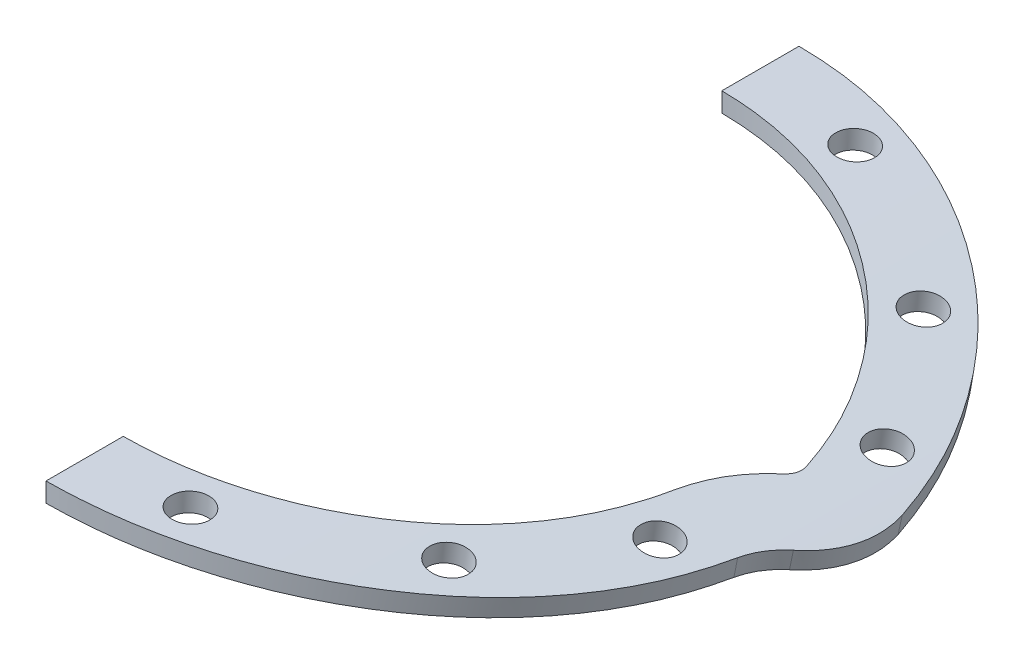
ISO-10303-21;
HEADER;
FILE_DESCRIPTION(('STEP AP214'),'2;1');
FILE_NAME('part.step','',(''),(''),'','','');
FILE_SCHEMA(('AUTOMOTIVE_DESIGN { 1 0 10303 214 1 1 1 1 }'));
ENDSEC;
DATA;
#1=APPLICATION_CONTEXT('core data for automotive mechanical design processes');
#2=APPLICATION_PROTOCOL_DEFINITION('international standard','automotive_design',2000,#1);
#3=PRODUCT_CONTEXT('',#1,'mechanical');
#4=PRODUCT('Part','Part','',(#3));
#5=PRODUCT_RELATED_PRODUCT_CATEGORY('part','',(#4));
#6=PRODUCT_DEFINITION_FORMATION('','',#4);
#7=PRODUCT_DEFINITION_CONTEXT('part definition',#1,'design');
#8=PRODUCT_DEFINITION('design','',#6,#7);
#9=PRODUCT_DEFINITION_SHAPE('','',#8);
#10=(LENGTH_UNIT() NAMED_UNIT(*) SI_UNIT(.MILLI.,.METRE.));
#11=(NAMED_UNIT(*) PLANE_ANGLE_UNIT() SI_UNIT($,.RADIAN.));
#12=(NAMED_UNIT(*) SI_UNIT($,.STERADIAN.) SOLID_ANGLE_UNIT());
#13=UNCERTAINTY_MEASURE_WITH_UNIT(LENGTH_MEASURE(1.E-05),#10,'distance_accuracy_value','');
#14=(GEOMETRIC_REPRESENTATION_CONTEXT(3) GLOBAL_UNCERTAINTY_ASSIGNED_CONTEXT((#13)) GLOBAL_UNIT_ASSIGNED_CONTEXT((#10,
#11,#12)) REPRESENTATION_CONTEXT('',''));
#15=CARTESIAN_POINT('',(0.,0.,0.));
#16=DIRECTION('',(0.,0.,1.));
#17=DIRECTION('',(1.,0.,0.));
#18=AXIS2_PLACEMENT_3D('',#15,#16,#17);
#19=CARTESIAN_POINT('',(87.5177435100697,492.281062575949,85.6470588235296));
#20=CARTESIAN_POINT('',(86.062112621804,492.539844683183,80.6937765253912));
#21=CARTESIAN_POINT('',(84.3429071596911,492.839041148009,76.1051654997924));
#22=CARTESIAN_POINT('',(82.1107870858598,493.211802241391,71.3532386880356));
#23=CARTESIAN_POINT('',(81.8586343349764,493.253719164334,70.8309448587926));
#24=CARTESIAN_POINT('',(81.5382655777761,493.306715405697,70.1852001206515));
#25=CARTESIAN_POINT('',(81.473015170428,493.317496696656,70.0545735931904));
#26=CARTESIAN_POINT('',(81.337042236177,493.339933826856,69.7841099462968));
#27=CARTESIAN_POINT('',(81.2687020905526,493.351196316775,69.6490386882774));
#28=CARTESIAN_POINT('',(81.0626204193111,493.385114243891,69.2443066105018));
#29=CARTESIAN_POINT('',(80.9238176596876,493.407900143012,68.975127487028));
#30=CARTESIAN_POINT('',(80.2227262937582,493.52268154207,67.6324431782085));
#31=CARTESIAN_POINT('',(79.6392050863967,493.61723421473,66.5685719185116));
#32=CARTESIAN_POINT('',(77.8205918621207,493.908354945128,63.407786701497));
#33=CARTESIAN_POINT('',(76.5156708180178,494.112675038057,61.3391157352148));
#34=CARTESIAN_POINT('',(69.5537420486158,495.170690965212,51.2271403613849));
#35=CARTESIAN_POINT('',(62.8317861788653,496.100021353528,44.2209392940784));
#36=CARTESIAN_POINT('',(50.9919331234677,497.408874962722,35.3298069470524));
#37=CARTESIAN_POINT('',(46.8581406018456,497.818362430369,32.7156901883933));
#38=CARTESIAN_POINT('',(40.3766141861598,498.371779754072,29.3189060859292));
#39=CARTESIAN_POINT('',(38.1693076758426,498.546097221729,28.2740432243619));
#40=CARTESIAN_POINT('',(34.7882289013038,498.789590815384,26.837846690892));
#41=CARTESIAN_POINT('',(33.6495167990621,498.867757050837,26.3809641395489));
#42=CARTESIAN_POINT('',(31.9239358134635,498.980154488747,25.7284147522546));
#43=CARTESIAN_POINT('',(31.3458233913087,499.016811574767,25.5163606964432));
#44=CARTESIAN_POINT('',(30.474279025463,499.070539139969,25.2064732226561));
#45=CARTESIAN_POINT('',(30.1830349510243,499.088238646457,25.1045429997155));
#46=CARTESIAN_POINT('',(29.7450752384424,499.11446772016,24.953696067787));
#47=CARTESIAN_POINT('',(29.5989064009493,499.123157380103,24.9037551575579));
#48=CARTESIAN_POINT('',(29.3062042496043,499.140429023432,24.8045561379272));
#49=CARTESIAN_POINT('',(29.1558625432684,499.149232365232,24.7540282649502));
#50=CARTESIAN_POINT('',(19.8668990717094,499.689142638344,21.6569768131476));
#51=CARTESIAN_POINT('',(10.1916668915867,500.,20.0881857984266));
#52=CARTESIAN_POINT('',(0.,500.,20.));
#53=CARTESIAN_POINT('',(86.642566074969,487.35825195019,85.6470588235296));
#54=CARTESIAN_POINT('',(85.2014914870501,487.614446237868,80.6937764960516));
#55=CARTESIAN_POINT('',(83.4994780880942,487.910650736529,76.1051654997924));
#56=CARTESIAN_POINT('',(81.2896792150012,488.279684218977,71.3532386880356));
#57=CARTESIAN_POINT('',(81.0400479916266,488.321181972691,70.8309448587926));
#58=CARTESIAN_POINT('',(80.7228829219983,488.37364825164,70.1852001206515));
#59=CARTESIAN_POINT('',(80.6582850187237,488.384321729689,70.0545735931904));
#60=CARTESIAN_POINT('',(80.5236718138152,488.406534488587,69.7841099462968));
#61=CARTESIAN_POINT('',(80.4560150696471,488.417684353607,69.6490386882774));
#62=CARTESIAN_POINT('',(80.251994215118,488.451263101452,69.2443066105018));
#63=CARTESIAN_POINT('',(80.1145794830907,488.473821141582,68.975127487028));
#64=CARTESIAN_POINT('',(79.4204990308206,488.587454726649,67.6324431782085));
#65=CARTESIAN_POINT('',(78.8428130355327,488.681061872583,66.5685719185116));
#66=CARTESIAN_POINT('',(77.0423859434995,488.969271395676,63.407786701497));
#67=CARTESIAN_POINT('',(75.7505141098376,489.171548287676,61.3391157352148));
#68=CARTESIAN_POINT('',(68.8582046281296,490.21898405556,51.2271403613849));
#69=CARTESIAN_POINT('',(62.2034683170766,491.139021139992,44.2209392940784));
#70=CARTESIAN_POINT('',(50.482013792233,492.434786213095,35.3298069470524));
#71=CARTESIAN_POINT('',(46.3895591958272,492.840178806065,32.7156901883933));
#72=CARTESIAN_POINT('',(39.9728480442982,493.388061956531,29.3189060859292));
#73=CARTESIAN_POINT('',(37.7876145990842,493.560636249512,28.2740432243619));
#74=CARTESIAN_POINT('',(34.4403466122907,493.80169490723,26.837846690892));
#75=CARTESIAN_POINT('',(33.3130216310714,493.879079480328,26.3809641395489));
#76=CARTESIAN_POINT('',(31.6046964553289,493.990352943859,25.7284147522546));
#77=CARTESIAN_POINT('',(31.0323651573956,494.026643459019,25.5163606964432));
#78=CARTESIAN_POINT('',(30.1695362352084,494.07983374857,25.2064732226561));
#79=CARTESIAN_POINT('',(29.8812046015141,494.097356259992,25.1045429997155));
#80=CARTESIAN_POINT('',(29.4476244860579,494.123323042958,24.953696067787));
#81=CARTESIAN_POINT('',(29.3029173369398,494.131925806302,24.9037551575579));
#82=CARTESIAN_POINT('',(29.0131422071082,494.149024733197,24.8045561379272));
#83=CARTESIAN_POINT('',(28.8643039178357,494.15774004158,24.7540282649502));
#84=CARTESIAN_POINT('',(19.6682300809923,494.69225121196,21.6569768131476));
#85=CARTESIAN_POINT('',(10.0897502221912,495.,20.0881857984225));
#86=CARTESIAN_POINT('',(0.,495.,20.));
#87=B_SPLINE_SURFACE_WITH_KNOTS('',1,3,((#19,#20,#21,#22,#23,#24,#25,#26,#27,#28,#29,#30,#31,
#32,#33,#34,#35,#36,#37,#38,#39,#40,#41,#42,#43,#44,#45,#46,#47,#48,#49,#50,#51,#52),(#53,#54,
#55,#56,#57,#58,#59,#60,#61,#62,#63,#64,#65,#66,#67,#68,#69,#70,#71,#72,#73,#74,#75,#76,#77,#78,
#79,#80,#81,#82,#83,#84,#85,#86)),.UNSPECIFIED.,.F.,.F.,.F.,(2,2),(4,2,2,2,2,2,2,2,2,2,2,2,2,2,
2,2,4),(0.,1.),(0.,0.125,0.140625,0.14453125,0.1484375,0.15625,0.1875,0.25,0.5,0.625,0.6875,
0.71875,0.734375,0.7421875,0.74609375,0.75,1.),.UNSPECIFIED.);
#88=CARTESIAN_POINT('',(87.5177435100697,492.281062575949,85.6470588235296));
#89=CARTESIAN_POINT('',(86.642566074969,487.35825195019,85.6470588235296));
#90=B_SPLINE_CURVE_WITH_KNOTS('',1,(#88,#89),.UNSPECIFIED.,.F.,.F.,(2,2),(0.,1.),.UNSPECIFIED.);
#91=CARTESIAN_POINT('',(87.5177419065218,492.281062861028,85.6470533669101));
#92=VERTEX_POINT('',#91);
#93=CARTESIAN_POINT('',(86.642566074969,487.35825195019,85.6470588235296));
#94=VERTEX_POINT('',#93);
#95=EDGE_CURVE('E12',#92,#94,#90,.T.);
#96=CARTESIAN_POINT('',(87.5177435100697,492.281062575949,85.6470588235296));
#97=CARTESIAN_POINT('',(86.062112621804,492.539844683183,80.6937765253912));
#98=CARTESIAN_POINT('',(84.3429071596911,492.839041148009,76.1051654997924));
#99=CARTESIAN_POINT('',(82.1107870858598,493.211802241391,71.3532386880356));
#100=CARTESIAN_POINT('',(81.8586343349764,493.253719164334,70.8309448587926));
#101=CARTESIAN_POINT('',(81.5382655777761,493.306715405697,70.1852001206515));
#102=CARTESIAN_POINT('',(81.473015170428,493.317496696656,70.0545735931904));
#103=CARTESIAN_POINT('',(81.337042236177,493.339933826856,69.7841099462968));
#104=CARTESIAN_POINT('',(81.2687020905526,493.351196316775,69.6490386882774));
#105=CARTESIAN_POINT('',(81.0626204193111,493.385114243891,69.2443066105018));
#106=CARTESIAN_POINT('',(80.9238176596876,493.407900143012,68.975127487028));
#107=CARTESIAN_POINT('',(80.2227262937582,493.52268154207,67.6324431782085));
#108=CARTESIAN_POINT('',(79.6392050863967,493.61723421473,66.5685719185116));
#109=CARTESIAN_POINT('',(77.8205918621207,493.908354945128,63.407786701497));
#110=CARTESIAN_POINT('',(76.5156708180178,494.112675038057,61.3391157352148));
#111=CARTESIAN_POINT('',(69.5537420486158,495.170690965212,51.2271403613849));
#112=CARTESIAN_POINT('',(62.8317861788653,496.100021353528,44.2209392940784));
#113=CARTESIAN_POINT('',(50.9919331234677,497.408874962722,35.3298069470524));
#114=CARTESIAN_POINT('',(46.8581406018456,497.818362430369,32.7156901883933));
#115=CARTESIAN_POINT('',(40.3766141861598,498.371779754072,29.3189060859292));
#116=CARTESIAN_POINT('',(38.1693076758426,498.546097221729,28.2740432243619));
#117=CARTESIAN_POINT('',(34.7882289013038,498.789590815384,26.837846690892));
#118=CARTESIAN_POINT('',(33.6495167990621,498.867757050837,26.3809641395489));
#119=CARTESIAN_POINT('',(31.9239358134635,498.980154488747,25.7284147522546));
#120=CARTESIAN_POINT('',(31.3458233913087,499.016811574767,25.5163606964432));
#121=CARTESIAN_POINT('',(30.474279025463,499.070539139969,25.2064732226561));
#122=CARTESIAN_POINT('',(30.1830349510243,499.088238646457,25.1045429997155));
#123=CARTESIAN_POINT('',(29.7450752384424,499.11446772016,24.953696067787));
#124=CARTESIAN_POINT('',(29.5989064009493,499.123157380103,24.9037551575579));
#125=CARTESIAN_POINT('',(29.3062042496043,499.140429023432,24.8045561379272));
#126=CARTESIAN_POINT('',(29.1558625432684,499.149232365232,24.7540282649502));
#127=CARTESIAN_POINT('',(19.8668990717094,499.689142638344,21.6569768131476));
#128=CARTESIAN_POINT('',(10.1916668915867,500.,20.0881857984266));
#129=CARTESIAN_POINT('',(0.,500.,20.));
#130=B_SPLINE_CURVE_WITH_KNOTS('',3,(#96,#97,#98,#99,#100,#101,#102,#103,#104,#105,#106,#107,
#108,#109,#110,#111,#112,#113,#114,#115,#116,#117,#118,#119,#120,#121,#122,#123,#124,#125,#126,
#127,#128,#129),.UNSPECIFIED.,.F.,.F.,(4,2,2,2,2,2,2,2,2,2,2,2,2,2,2,2,4),(0.,0.125,0.140625,
0.14453125,0.1484375,0.15625,0.1875,0.25,0.5,0.625,0.6875,0.71875,0.734375,0.7421875,0.74609375,
0.75,1.),.UNSPECIFIED.);
#131=CARTESIAN_POINT('',(0.,500.,20.));
#132=VERTEX_POINT('',#131);
#133=EDGE_CURVE('E338',#92,#132,#130,.T.);
#134=CARTESIAN_POINT('',(0.,500.,20.));
#135=CARTESIAN_POINT('',(0.,495.,20.));
#136=B_SPLINE_CURVE_WITH_KNOTS('',1,(#134,#135),.UNSPECIFIED.,.F.,.F.,(2,2),(0.,1.),.UNSPECIFIED.);
#137=CARTESIAN_POINT('',(0.,495.,20.));
#138=VERTEX_POINT('',#137);
#139=EDGE_CURVE('E291',#132,#138,#136,.T.);
#140=CARTESIAN_POINT('',(0.,495.,20.));
#141=CARTESIAN_POINT('',(10.0897502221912,495.,20.0881857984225));
#142=CARTESIAN_POINT('',(19.6682300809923,494.69225121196,21.6569768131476));
#143=CARTESIAN_POINT('',(28.8643039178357,494.15774004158,24.7540282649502));
#144=CARTESIAN_POINT('',(29.0131422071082,494.149024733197,24.8045561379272));
#145=CARTESIAN_POINT('',(29.3029173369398,494.131925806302,24.9037551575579));
#146=CARTESIAN_POINT('',(29.4476244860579,494.123323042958,24.953696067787));
#147=CARTESIAN_POINT('',(29.8812046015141,494.097356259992,25.1045429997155));
#148=CARTESIAN_POINT('',(30.1695362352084,494.07983374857,25.2064732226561));
#149=CARTESIAN_POINT('',(31.0323651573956,494.026643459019,25.5163606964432));
#150=CARTESIAN_POINT('',(31.6046964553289,493.990352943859,25.7284147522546));
#151=CARTESIAN_POINT('',(33.3130216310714,493.879079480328,26.3809641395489));
#152=CARTESIAN_POINT('',(34.4403466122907,493.80169490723,26.837846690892));
#153=CARTESIAN_POINT('',(37.7876145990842,493.560636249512,28.2740432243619));
#154=CARTESIAN_POINT('',(39.9728480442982,493.388061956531,29.3189060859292));
#155=CARTESIAN_POINT('',(46.3895591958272,492.840178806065,32.7156901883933));
#156=CARTESIAN_POINT('',(50.482013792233,492.434786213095,35.3298069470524));
#157=CARTESIAN_POINT('',(62.2034683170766,491.139021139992,44.2209392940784));
#158=CARTESIAN_POINT('',(68.8582046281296,490.21898405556,51.2271403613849));
#159=CARTESIAN_POINT('',(75.7505141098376,489.171548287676,61.3391157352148));
#160=CARTESIAN_POINT('',(77.0423859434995,488.969271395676,63.407786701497));
#161=CARTESIAN_POINT('',(78.8428130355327,488.681061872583,66.5685719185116));
#162=CARTESIAN_POINT('',(79.4204990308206,488.587454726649,67.6324431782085));
#163=CARTESIAN_POINT('',(80.1145794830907,488.473821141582,68.975127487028));
#164=CARTESIAN_POINT('',(80.251994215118,488.451263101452,69.2443066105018));
#165=CARTESIAN_POINT('',(80.4560150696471,488.417684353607,69.6490386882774));
#166=CARTESIAN_POINT('',(80.5236718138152,488.406534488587,69.7841099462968));
#167=CARTESIAN_POINT('',(80.6582850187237,488.384321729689,70.0545735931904));
#168=CARTESIAN_POINT('',(80.7228829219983,488.37364825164,70.1852001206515));
#169=CARTESIAN_POINT('',(81.0400479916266,488.321181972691,70.8309448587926));
#170=CARTESIAN_POINT('',(81.2896792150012,488.279684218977,71.3532386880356));
#171=CARTESIAN_POINT('',(83.4994780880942,487.910650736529,76.1051654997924));
#172=CARTESIAN_POINT('',(85.2014914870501,487.614446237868,80.6937764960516));
#173=CARTESIAN_POINT('',(86.642566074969,487.35825195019,85.6470588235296));
#174=B_SPLINE_CURVE_WITH_KNOTS('',3,(#140,#141,#142,#143,#144,#145,#146,#147,#148,#149,#150,
#151,#152,#153,#154,#155,#156,#157,#158,#159,#160,#161,#162,#163,#164,#165,#166,#167,#168,#169,
#170,#171,#172,#173),.UNSPECIFIED.,.F.,.F.,(4,2,2,2,2,2,2,2,2,2,2,2,2,2,2,2,4),(0.,0.25,
0.25390625,0.2578125,0.265625,0.28125,0.3125,0.375,0.5,0.75,0.8125,0.84375,0.8515625,0.85546875,
0.859375,0.875,1.),.UNSPECIFIED.);
#175=EDGE_CURVE('E342',#94,#138,#174,.F.);
#176=ORIENTED_EDGE('',*,*,#95,.F.);
#177=ORIENTED_EDGE('',*,*,#133,.T.);
#178=ORIENTED_EDGE('',*,*,#139,.T.);
#179=ORIENTED_EDGE('',*,*,#175,.F.);
#180=EDGE_LOOP('',(#176,#177,#178,#179));
#181=FACE_BOUND('',#180,.T.);
#182=ADVANCED_FACE('F276',(#181),#87,.F.);
#183=CARTESIAN_POINT('',(0.,495.,10.));
#184=DIRECTION('',(1.,0.,0.));
#185=DIRECTION('',(0.,0.,-1.));
#186=AXIS2_PLACEMENT_3D('',#183,#184,#185);
#187=PLANE('',#186);
#188=ORIENTED_EDGE('',*,*,#139,.F.);
#189=DIRECTION('',(0.,0.,1.));
#190=VECTOR('',#189,1.);
#191=CARTESIAN_POINT('',(0.,500.,-38.1525445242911));
#192=LINE('',#191,#190);
#193=CARTESIAN_POINT('',(0.,500.,1.11022302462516E-12));
#194=VERTEX_POINT('',#193);
#195=EDGE_CURVE('E362',#132,#194,#192,.F.);
#196=ORIENTED_EDGE('',*,*,#195,.T.);
#197=CARTESIAN_POINT('',(0.,495.,1.11022302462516E-12));
#198=CARTESIAN_POINT('',(0.,500.,1.11022302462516E-12));
#199=B_SPLINE_CURVE_WITH_KNOTS('',1,(#197,#198),.UNSPECIFIED.,.F.,.F.,(2,2),(0.,1.),.UNSPECIFIED.);
#200=CARTESIAN_POINT('',(0.,495.,0.));
#201=VERTEX_POINT('',#200);
#202=EDGE_CURVE('E453',#194,#201,#199,.F.);
#203=ORIENTED_EDGE('',*,*,#202,.T.);
#204=DIRECTION('',(0.,0.,-1.));
#205=VECTOR('',#204,1.);
#206=CARTESIAN_POINT('',(0.,495.,20.));
#207=LINE('',#206,#205);
#208=EDGE_CURVE('E478',#138,#201,#207,.T.);
#209=ORIENTED_EDGE('',*,*,#208,.F.);
#210=EDGE_LOOP('',(#188,#196,#203,#209));
#211=FACE_BOUND('',#210,.T.);
#212=ADVANCED_FACE('F421',(#211),#187,.F.);
#213=CARTESIAN_POINT('',(0.,500.,1.11022302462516E-12));
#214=CARTESIAN_POINT('',(3.20760241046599,500.,0.0275151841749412));
#215=CARTESIAN_POINT('',(6.31129541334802,499.969165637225,0.161471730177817));
#216=CARTESIAN_POINT('',(10.8102746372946,499.885374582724,0.522068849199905));
#217=CARTESIAN_POINT('',(12.2838427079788,499.851181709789,0.668878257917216));
#218=CARTESIAN_POINT('',(14.454994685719,499.791533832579,0.929007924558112));
#219=CARTESIAN_POINT('',(15.1721788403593,499.77025773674,1.02237040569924));
#220=CARTESIAN_POINT('',(16.2381490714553,499.736379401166,1.17239301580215));
#221=CARTESIAN_POINT('',(16.59183815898,499.724759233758,1.22406370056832));
#222=CARTESIAN_POINT('',(17.1199196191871,499.706853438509,1.3040644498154));
#223=CARTESIAN_POINT('',(17.295538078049,499.700805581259,1.33114715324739));
#224=CARTESIAN_POINT('',(17.5583526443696,499.691616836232,1.37239488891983));
#225=CARTESIAN_POINT('',(17.6458553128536,499.688534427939,1.38624808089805));
#226=CARTESIAN_POINT('',(17.8206562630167,499.682330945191,1.41416235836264));
#227=CARTESIAN_POINT('',(17.9027741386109,499.67939643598,1.4273818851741));
#228=CARTESIAN_POINT('',(20.9511982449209,499.569611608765,1.92259938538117));
#229=CARTESIAN_POINT('',(23.8875624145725,499.437597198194,2.52273926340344));
#230=CARTESIAN_POINT('',(28.26196526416,499.202758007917,3.60284253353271));
#231=CARTESIAN_POINT('',(29.7150761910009,499.118341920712,3.99285919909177));
#232=CARTESIAN_POINT('',(32.6111547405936,498.937488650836,4.83285701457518));
#233=CARTESIAN_POINT('',(34.0577828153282,498.840790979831,5.28406004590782));
#234=CARTESIAN_POINT('',(46.9654868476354,497.922234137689,9.59273364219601));
#235=CARTESIAN_POINT('',(57.5262900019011,496.775022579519,15.1305281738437));
#236=CARTESIAN_POINT('',(71.9908417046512,494.814099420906,25.9978759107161));
#237=CARTESIAN_POINT('',(76.453779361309,494.137770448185,29.9489040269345));
#238=CARTESIAN_POINT('',(82.6142013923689,493.132054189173,36.3683145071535));
#239=CARTESIAN_POINT('',(84.5786925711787,492.798206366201,38.5902627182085));
#240=CARTESIAN_POINT('',(87.3925355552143,492.304226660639,42.0464021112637));
#241=CARTESIAN_POINT('',(88.3083347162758,492.14069429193,43.2189847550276));
#242=CARTESIAN_POINT('',(90.095736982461,491.816615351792,45.6052224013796));
#243=CARTESIAN_POINT('',(90.9698667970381,491.655596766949,46.8225480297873));
#244=CARTESIAN_POINT('',(93.5109558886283,491.18089449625,50.5141096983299));
#245=CARTESIAN_POINT('',(95.0982048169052,490.875350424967,53.0333280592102));
#246=CARTESIAN_POINT('',(97.3196302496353,490.43802780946,56.8994214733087));
#247=CARTESIAN_POINT('',(98.033530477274,490.29574602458,58.2026635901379));
#248=CARTESIAN_POINT('',(98.8927641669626,490.122690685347,59.8498966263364));
#249=CARTESIAN_POINT('',(99.0658105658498,490.087739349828,60.1858343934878));
#250=CARTESIAN_POINT('',(99.3884088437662,490.022419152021,60.8200807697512));
#251=CARTESIAN_POINT('',(99.5483601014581,489.989949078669,61.1387333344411));
#252=CARTESIAN_POINT('',(100.024172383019,489.893120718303,62.0992791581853));
#253=CARTESIAN_POINT('',(100.335991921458,489.829344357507,62.7457605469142));
#254=CARTESIAN_POINT('',(103.093920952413,489.262615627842,68.6191506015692));
#255=CARTESIAN_POINT('',(105.20094774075,488.810828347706,74.2314653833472));
#256=CARTESIAN_POINT('',(106.966130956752,488.42424881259,80.2352941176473));
#257=CARTESIAN_POINT('',(0.,495.,1.11022302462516E-12));
#258=CARTESIAN_POINT('',(3.17552638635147,495.,0.0275151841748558));
#259=CARTESIAN_POINT('',(6.24818245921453,494.969473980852,0.161471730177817));
#260=CARTESIAN_POINT('',(10.7021718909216,494.886520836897,0.522068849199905));
#261=CARTESIAN_POINT('',(12.161004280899,494.852669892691,0.668878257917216));
#262=CARTESIAN_POINT('',(14.3104447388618,494.793618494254,0.929007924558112));
#263=CARTESIAN_POINT('',(15.0204570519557,494.772555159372,1.02237040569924));
#264=CARTESIAN_POINT('',(16.0757675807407,494.739015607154,1.17239301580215));
#265=CARTESIAN_POINT('',(16.4259197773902,494.727511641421,1.22406370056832));
#266=CARTESIAN_POINT('',(16.9487204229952,494.709784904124,1.3040644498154));
#267=CARTESIAN_POINT('',(17.1225826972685,494.703797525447,1.33114715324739));
#268=CARTESIAN_POINT('',(17.3827691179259,494.69470066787,1.37239488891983));
#269=CARTESIAN_POINT('',(17.4693967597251,494.69164908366,1.38624808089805));
#270=CARTESIAN_POINT('',(17.6424497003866,494.685507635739,1.41416235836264));
#271=CARTESIAN_POINT('',(17.7237463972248,494.68260247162,1.4273818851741));
#272=CARTESIAN_POINT('',(20.7416862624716,494.573915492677,1.92259938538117));
#273=CARTESIAN_POINT('',(23.6486867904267,494.443221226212,2.52273926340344));
#274=CARTESIAN_POINT('',(27.9793456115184,494.210730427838,3.60284253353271));
#275=CARTESIAN_POINT('',(29.4179254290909,494.127158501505,3.99285919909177));
#276=CARTESIAN_POINT('',(32.2850431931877,493.948113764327,4.83285701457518));
#277=CARTESIAN_POINT('',(33.7172049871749,493.852383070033,5.28406004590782));
#278=CARTESIAN_POINT('',(46.495831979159,492.943011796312,9.59273364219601));
#279=CARTESIAN_POINT('',(56.951027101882,491.807272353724,15.1305281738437));
#280=CARTESIAN_POINT('',(71.2709332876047,489.865958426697,25.9978759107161));
#281=CARTESIAN_POINT('',(75.6892415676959,489.196392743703,29.9489040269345));
#282=CARTESIAN_POINT('',(81.7880593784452,488.200733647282,36.3683145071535));
#283=CARTESIAN_POINT('',(83.732905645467,487.870224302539,38.5902627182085));
#284=CARTESIAN_POINT('',(86.5186101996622,487.381184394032,42.0464021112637));
#285=CARTESIAN_POINT('',(87.425251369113,487.219287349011,43.2189847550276));
#286=CARTESIAN_POINT('',(89.1947796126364,486.898449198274,45.6052224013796));
#287=CARTESIAN_POINT('',(90.0601681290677,486.739040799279,46.8225480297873));
#288=CARTESIAN_POINT('',(92.575846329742,486.269085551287,50.5141096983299));
#289=CARTESIAN_POINT('',(94.1472227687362,485.966596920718,53.0333280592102));
#290=CARTESIAN_POINT('',(96.346433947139,485.533647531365,56.8994214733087));
#291=CARTESIAN_POINT('',(97.0531951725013,485.392788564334,58.2026635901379));
#292=CARTESIAN_POINT('',(97.903836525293,485.221463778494,59.8498966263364));
#293=CARTESIAN_POINT('',(98.0751524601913,485.18686195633,60.1858343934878));
#294=CARTESIAN_POINT('',(98.3945247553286,485.122194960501,60.8200807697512));
#295=CARTESIAN_POINT('',(98.5528765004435,485.090049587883,61.1387333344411));
#296=CARTESIAN_POINT('',(99.0239306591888,484.99418951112,62.0992791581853));
#297=CARTESIAN_POINT('',(99.332632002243,484.931050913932,62.7457605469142));
#298=CARTESIAN_POINT('',(102.062981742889,484.369989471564,68.6191506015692));
#299=CARTESIAN_POINT('',(104.148938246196,483.922720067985,74.2314653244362));
#300=CARTESIAN_POINT('',(105.896469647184,483.540006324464,80.2352941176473));
#301=B_SPLINE_SURFACE_WITH_KNOTS('',1,3,((#213,#214,#215,#216,#217,#218,#219,#220,#221,#222,
#223,#224,#225,#226,#227,#228,#229,#230,#231,#232,#233,#234,#235,#236,#237,#238,#239,#240,#241,
#242,#243,#244,#245,#246,#247,#248,#249,#250,#251,#252,#253,#254,#255,#256),(#257,#258,#259,
#260,#261,#262,#263,#264,#265,#266,#267,#268,#269,#270,#271,#272,#273,#274,#275,#276,#277,#278,
#279,#280,#281,#282,#283,#284,#285,#286,#287,#288,#289,#290,#291,#292,#293,#294,#295,#296,#297,
#298,#299,#300)),.UNSPECIFIED.,.F.,.F.,.F.,(2,2),(4,2,2,2,2,2,2,2,2,2,2,2,2,2,2,2,2,2,2,2,2,4),
(0.,1.),(0.,0.0625,0.09375,0.109375,0.1171875,0.12109375,0.123046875,0.125,0.1875,0.21875,0.25,
0.5,0.625,0.6875,0.71875,0.75,0.8125,0.84375,0.8515625,0.859375,0.875,1.),.UNSPECIFIED.);
#302=CARTESIAN_POINT('',(0.,500.,1.11022302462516E-12));
#303=CARTESIAN_POINT('',(3.20760241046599,500.,0.0275151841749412));
#304=CARTESIAN_POINT('',(6.31129541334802,499.969165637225,0.161471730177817));
#305=CARTESIAN_POINT('',(10.8102746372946,499.885374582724,0.522068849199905));
#306=CARTESIAN_POINT('',(12.2838427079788,499.851181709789,0.668878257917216));
#307=CARTESIAN_POINT('',(14.454994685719,499.791533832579,0.929007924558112));
#308=CARTESIAN_POINT('',(15.1721788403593,499.77025773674,1.02237040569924));
#309=CARTESIAN_POINT('',(16.2381490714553,499.736379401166,1.17239301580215));
#310=CARTESIAN_POINT('',(16.59183815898,499.724759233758,1.22406370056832));
#311=CARTESIAN_POINT('',(17.1199196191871,499.706853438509,1.3040644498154));
#312=CARTESIAN_POINT('',(17.295538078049,499.700805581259,1.33114715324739));
#313=CARTESIAN_POINT('',(17.5583526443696,499.691616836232,1.37239488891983));
#314=CARTESIAN_POINT('',(17.6458553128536,499.688534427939,1.38624808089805));
#315=CARTESIAN_POINT('',(17.8206562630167,499.682330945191,1.41416235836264));
#316=CARTESIAN_POINT('',(17.9027741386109,499.67939643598,1.4273818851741));
#317=CARTESIAN_POINT('',(20.9511982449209,499.569611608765,1.92259938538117));
#318=CARTESIAN_POINT('',(23.8875624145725,499.437597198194,2.52273926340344));
#319=CARTESIAN_POINT('',(28.26196526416,499.202758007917,3.60284253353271));
#320=CARTESIAN_POINT('',(29.7150761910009,499.118341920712,3.99285919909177));
#321=CARTESIAN_POINT('',(32.6111547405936,498.937488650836,4.83285701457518));
#322=CARTESIAN_POINT('',(34.0577828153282,498.840790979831,5.28406004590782));
#323=CARTESIAN_POINT('',(46.9654868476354,497.922234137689,9.59273364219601));
#324=CARTESIAN_POINT('',(57.5262900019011,496.775022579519,15.1305281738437));
#325=CARTESIAN_POINT('',(71.9908417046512,494.814099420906,25.9978759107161));
#326=CARTESIAN_POINT('',(76.453779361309,494.137770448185,29.9489040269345));
#327=CARTESIAN_POINT('',(82.6142013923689,493.132054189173,36.3683145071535));
#328=CARTESIAN_POINT('',(84.5786925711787,492.798206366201,38.5902627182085));
#329=CARTESIAN_POINT('',(87.3925355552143,492.304226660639,42.0464021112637));
#330=CARTESIAN_POINT('',(88.3083347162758,492.14069429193,43.2189847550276));
#331=CARTESIAN_POINT('',(90.095736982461,491.816615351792,45.6052224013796));
#332=CARTESIAN_POINT('',(90.9698667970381,491.655596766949,46.8225480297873));
#333=CARTESIAN_POINT('',(93.5109558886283,491.18089449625,50.5141096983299));
#334=CARTESIAN_POINT('',(95.0982048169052,490.875350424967,53.0333280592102));
#335=CARTESIAN_POINT('',(97.3196302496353,490.43802780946,56.8994214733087));
#336=CARTESIAN_POINT('',(98.033530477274,490.29574602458,58.2026635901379));
#337=CARTESIAN_POINT('',(98.8927641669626,490.122690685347,59.8498966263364));
#338=CARTESIAN_POINT('',(99.0658105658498,490.087739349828,60.1858343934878));
#339=CARTESIAN_POINT('',(99.3884088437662,490.022419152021,60.8200807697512));
#340=CARTESIAN_POINT('',(99.5483601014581,489.989949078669,61.1387333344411));
#341=CARTESIAN_POINT('',(100.024172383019,489.893120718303,62.0992791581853));
#342=CARTESIAN_POINT('',(100.335991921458,489.829344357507,62.7457605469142));
#343=CARTESIAN_POINT('',(103.093920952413,489.262615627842,68.6191506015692));
#344=CARTESIAN_POINT('',(105.20094774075,488.810828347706,74.2314653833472));
#345=CARTESIAN_POINT('',(106.966130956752,488.42424881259,80.2352941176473));
#346=B_SPLINE_CURVE_WITH_KNOTS('',3,(#302,#303,#304,#305,#306,#307,#308,#309,#310,#311,#312,
#313,#314,#315,#316,#317,#318,#319,#320,#321,#322,#323,#324,#325,#326,#327,#328,#329,#330,#331,
#332,#333,#334,#335,#336,#337,#338,#339,#340,#341,#342,#343,#344,#345),.UNSPECIFIED.,.F.,.F.,(4,
2,2,2,2,2,2,2,2,2,2,2,2,2,2,2,2,2,2,2,2,4),(0.,0.0625,0.09375,0.109375,0.1171875,0.12109375,
0.123046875,0.125,0.1875,0.21875,0.25,0.5,0.625,0.6875,0.71875,0.75,0.8125,0.84375,0.8515625,
0.859375,0.875,1.),.UNSPECIFIED.);
#347=CARTESIAN_POINT('',(106.966130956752,488.42424881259,80.2352941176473));
#348=VERTEX_POINT('',#347);
#349=EDGE_CURVE('E494',#194,#348,#346,.T.);
#350=CARTESIAN_POINT('',(106.966130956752,488.42424881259,80.2352941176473));
#351=CARTESIAN_POINT('',(105.896469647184,483.540006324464,80.2352941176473));
#352=B_SPLINE_CURVE_WITH_KNOTS('',1,(#350,#351),.UNSPECIFIED.,.F.,.F.,(2,2),(0.,1.),.UNSPECIFIED.);
#353=CARTESIAN_POINT('',(105.896469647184,483.540006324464,80.2352941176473));
#354=VERTEX_POINT('',#353);
#355=EDGE_CURVE('E856',#348,#354,#352,.T.);
#356=CARTESIAN_POINT('',(105.896469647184,483.540006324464,80.2352941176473));
#357=CARTESIAN_POINT('',(104.148938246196,483.922720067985,74.2314653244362));
#358=CARTESIAN_POINT('',(102.062981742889,484.369989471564,68.6191506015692));
#359=CARTESIAN_POINT('',(99.332632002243,484.931050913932,62.7457605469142));
#360=CARTESIAN_POINT('',(99.0239306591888,484.99418951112,62.0992791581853));
#361=CARTESIAN_POINT('',(98.5528765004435,485.090049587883,61.1387333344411));
#362=CARTESIAN_POINT('',(98.3945247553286,485.122194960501,60.8200807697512));
#363=CARTESIAN_POINT('',(98.0751524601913,485.18686195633,60.1858343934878));
#364=CARTESIAN_POINT('',(97.903836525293,485.221463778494,59.8498966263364));
#365=CARTESIAN_POINT('',(97.0531951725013,485.392788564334,58.2026635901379));
#366=CARTESIAN_POINT('',(96.346433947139,485.533647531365,56.8994214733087));
#367=CARTESIAN_POINT('',(94.1472227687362,485.966596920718,53.0333280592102));
#368=CARTESIAN_POINT('',(92.575846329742,486.269085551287,50.5141096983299));
#369=CARTESIAN_POINT('',(90.0601681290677,486.739040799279,46.8225480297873));
#370=CARTESIAN_POINT('',(89.1947796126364,486.898449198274,45.6052224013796));
#371=CARTESIAN_POINT('',(87.425251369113,487.219287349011,43.2189847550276));
#372=CARTESIAN_POINT('',(86.5186101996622,487.381184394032,42.0464021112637));
#373=CARTESIAN_POINT('',(83.732905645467,487.870224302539,38.5902627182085));
#374=CARTESIAN_POINT('',(81.7880593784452,488.200733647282,36.3683145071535));
#375=CARTESIAN_POINT('',(75.6892415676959,489.196392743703,29.9489040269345));
#376=CARTESIAN_POINT('',(71.2709332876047,489.865958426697,25.9978759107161));
#377=CARTESIAN_POINT('',(56.951027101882,491.807272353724,15.1305281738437));
#378=CARTESIAN_POINT('',(46.495831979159,492.943011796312,9.59273364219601));
#379=CARTESIAN_POINT('',(33.7172049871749,493.852383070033,5.28406004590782));
#380=CARTESIAN_POINT('',(32.2850431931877,493.948113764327,4.83285701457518));
#381=CARTESIAN_POINT('',(29.4179254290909,494.127158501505,3.99285919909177));
#382=CARTESIAN_POINT('',(27.9793456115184,494.210730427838,3.60284253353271));
#383=CARTESIAN_POINT('',(23.6486867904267,494.443221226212,2.52273926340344));
#384=CARTESIAN_POINT('',(20.7416862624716,494.573915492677,1.92259938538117));
#385=CARTESIAN_POINT('',(17.7237463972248,494.68260247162,1.4273818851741));
#386=CARTESIAN_POINT('',(17.6424497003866,494.685507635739,1.41416235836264));
#387=CARTESIAN_POINT('',(17.4693967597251,494.69164908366,1.38624808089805));
#388=CARTESIAN_POINT('',(17.3827691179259,494.69470066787,1.37239488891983));
#389=CARTESIAN_POINT('',(17.1225826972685,494.703797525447,1.33114715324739));
#390=CARTESIAN_POINT('',(16.9487204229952,494.709784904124,1.3040644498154));
#391=CARTESIAN_POINT('',(16.4259197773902,494.727511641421,1.22406370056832));
#392=CARTESIAN_POINT('',(16.0757675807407,494.739015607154,1.17239301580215));
#393=CARTESIAN_POINT('',(15.0204570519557,494.772555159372,1.02237040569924));
#394=CARTESIAN_POINT('',(14.3104447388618,494.793618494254,0.929007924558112));
#395=CARTESIAN_POINT('',(12.161004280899,494.852669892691,0.668878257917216));
#396=CARTESIAN_POINT('',(10.7021718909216,494.886520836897,0.522068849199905));
#397=CARTESIAN_POINT('',(6.24818245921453,494.969473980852,0.161471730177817));
#398=CARTESIAN_POINT('',(3.17552638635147,495.,0.0275151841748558));
#399=CARTESIAN_POINT('',(0.,495.,1.11022302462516E-12));
#400=B_SPLINE_CURVE_WITH_KNOTS('',3,(#356,#357,#358,#359,#360,#361,#362,#363,#364,#365,#366,
#367,#368,#369,#370,#371,#372,#373,#374,#375,#376,#377,#378,#379,#380,#381,#382,#383,#384,#385,
#386,#387,#388,#389,#390,#391,#392,#393,#394,#395,#396,#397,#398,#399),.UNSPECIFIED.,.F.,.F.,(4,
2,2,2,2,2,2,2,2,2,2,2,2,2,2,2,2,2,2,2,2,4),(0.,0.125,0.140625,0.1484375,0.15625,0.1875,0.25,
0.28125,0.3125,0.375,0.5,0.75,0.78125,0.8125,0.875,0.876953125,0.87890625,0.8828125,0.890625,
0.90625,0.9375,1.),.UNSPECIFIED.);
#401=EDGE_CURVE('E483',#201,#354,#400,.F.);
#402=ORIENTED_EDGE('',*,*,#202,.F.);
#403=ORIENTED_EDGE('',*,*,#349,.T.);
#404=ORIENTED_EDGE('',*,*,#355,.T.);
#405=ORIENTED_EDGE('',*,*,#401,.F.);
#406=EDGE_LOOP('',(#402,#403,#404,#405));
#407=FACE_BOUND('',#406,.T.);
#408=ADVANCED_FACE('F430',(#407),#301,.F.);
#409=CARTESIAN_POINT('',(106.966130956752,488.42424881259,80.2352941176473));
#410=CARTESIAN_POINT('',(107.522710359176,488.302356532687,82.3227429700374));
#411=CARTESIAN_POINT('',(107.829299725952,488.234416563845,84.3818129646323));
#412=CARTESIAN_POINT('',(107.91466381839,488.21555299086,87.4278497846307));
#413=CARTESIAN_POINT('',(107.88069069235,488.223070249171,88.4361006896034));
#414=CARTESIAN_POINT('',(107.687871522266,488.265636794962,90.4384130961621));
#415=CARTESIAN_POINT('',(107.530183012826,488.300431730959,91.4273125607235));
#416=CARTESIAN_POINT('',(106.417781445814,488.544865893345,96.3879567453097));
#417=CARTESIAN_POINT('',(104.592066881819,488.946309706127,100.006608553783));
#418=CARTESIAN_POINT('',(101.823910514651,489.5221049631,103.27542211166));
#419=CARTESIAN_POINT('',(105.896469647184,483.540006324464,80.2352941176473));
#420=CARTESIAN_POINT('',(106.447483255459,483.419332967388,82.3227429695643));
#421=CARTESIAN_POINT('',(106.751006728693,483.352072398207,84.3818129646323));
#422=CARTESIAN_POINT('',(106.835517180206,483.333397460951,87.4278497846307));
#423=CARTESIAN_POINT('',(106.801883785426,483.34083954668,88.4361006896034));
#424=CARTESIAN_POINT('',(106.610992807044,483.382980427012,90.4384130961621));
#425=CARTESIAN_POINT('',(106.454881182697,483.417427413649,91.4273125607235));
#426=CARTESIAN_POINT('',(105.353603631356,483.659417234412,96.3879567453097));
#427=CARTESIAN_POINT('',(103.546146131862,484.056846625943,100.006608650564));
#428=CARTESIAN_POINT('',(100.805671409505,484.626883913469,103.27542211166));
#429=B_SPLINE_SURFACE_WITH_KNOTS('',1,3,((#409,#410,#411,#412,#413,#414,#415,#416,#417,#418),
(#419,#420,#421,#422,#423,#424,#425,#426,#427,#428)),.UNSPECIFIED.,.F.,.F.,.F.,(2,2),(4,2,2,2,
4),(0.,1.),(0.,0.25,0.375,0.5,1.),.UNSPECIFIED.);
#430=CARTESIAN_POINT('',(106.966130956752,488.42424881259,80.2352941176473));
#431=CARTESIAN_POINT('',(107.522710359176,488.302356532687,82.3227429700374));
#432=CARTESIAN_POINT('',(107.829299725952,488.234416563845,84.3818129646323));
#433=CARTESIAN_POINT('',(107.91466381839,488.21555299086,87.4278497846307));
#434=CARTESIAN_POINT('',(107.88069069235,488.223070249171,88.4361006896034));
#435=CARTESIAN_POINT('',(107.687871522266,488.265636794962,90.4384130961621));
#436=CARTESIAN_POINT('',(107.530183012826,488.300431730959,91.4273125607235));
#437=CARTESIAN_POINT('',(106.417781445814,488.544865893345,96.3879567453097));
#438=CARTESIAN_POINT('',(104.592066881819,488.946309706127,100.006608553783));
#439=CARTESIAN_POINT('',(101.823910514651,489.5221049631,103.27542211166));
#440=B_SPLINE_CURVE_WITH_KNOTS('',3,(#430,#431,#432,#433,#434,#435,#436,#437,#438,#439),
.UNSPECIFIED.,.F.,.F.,(4,2,2,2,4),(0.,0.25,0.375,0.5,1.),.UNSPECIFIED.);
#441=CARTESIAN_POINT('',(101.823910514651,489.5221049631,103.27542211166));
#442=VERTEX_POINT('',#441);
#443=EDGE_CURVE('E846',#348,#442,#440,.T.);
#444=CARTESIAN_POINT('',(101.823910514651,489.5221049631,103.27542211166));
#445=CARTESIAN_POINT('',(100.805671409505,484.626883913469,103.27542211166));
#446=B_SPLINE_CURVE_WITH_KNOTS('',1,(#444,#445),.UNSPECIFIED.,.F.,.F.,(2,2),(0.,1.),.UNSPECIFIED.);
#447=CARTESIAN_POINT('',(100.805671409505,484.626883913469,103.27542211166));
#448=VERTEX_POINT('',#447);
#449=EDGE_CURVE('E853',#442,#448,#446,.T.);
#450=CARTESIAN_POINT('',(100.805671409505,484.626883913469,103.27542211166));
#451=CARTESIAN_POINT('',(103.546146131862,484.056846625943,100.006608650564));
#452=CARTESIAN_POINT('',(105.353603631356,483.659417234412,96.3879567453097));
#453=CARTESIAN_POINT('',(106.454881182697,483.417427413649,91.4273125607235));
#454=CARTESIAN_POINT('',(106.610992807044,483.382980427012,90.4384130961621));
#455=CARTESIAN_POINT('',(106.801883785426,483.34083954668,88.4361006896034));
#456=CARTESIAN_POINT('',(106.835517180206,483.333397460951,87.4278497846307));
#457=CARTESIAN_POINT('',(106.751006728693,483.352072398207,84.3818129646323));
#458=CARTESIAN_POINT('',(106.447483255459,483.419332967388,82.3227429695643));
#459=CARTESIAN_POINT('',(105.896469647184,483.540006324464,80.2352941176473));
#460=B_SPLINE_CURVE_WITH_KNOTS('',3,(#450,#451,#452,#453,#454,#455,#456,#457,#458,#459),
.UNSPECIFIED.,.F.,.F.,(4,2,2,2,4),(0.,0.5,0.625,0.75,1.),.UNSPECIFIED.);
#461=EDGE_CURVE('E485',#354,#448,#460,.F.);
#462=ORIENTED_EDGE('',*,*,#355,.F.);
#463=ORIENTED_EDGE('',*,*,#443,.T.);
#464=ORIENTED_EDGE('',*,*,#449,.T.);
#465=ORIENTED_EDGE('',*,*,#461,.F.);
#466=EDGE_LOOP('',(#462,#463,#464,#465));
#467=FACE_BOUND('',#466,.T.);
#468=ADVANCED_FACE('F800',(#467),#429,.F.);
#469=CARTESIAN_POINT('',(101.823910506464,489.522104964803,103.275422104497));
#470=CARTESIAN_POINT('',(99.4059476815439,490.025057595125,106.168175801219));
#471=CARTESIAN_POINT('',(97.8684865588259,490.328666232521,109.441853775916));
#472=CARTESIAN_POINT('',(97.216645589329,490.457871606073,113.096481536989));
#473=CARTESIAN_POINT('',(100.8056714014,484.626883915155,103.275422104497));
#474=CARTESIAN_POINT('',(98.4118882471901,485.124807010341,106.168175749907));
#475=CARTESIAN_POINT('',(96.8898016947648,485.425379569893,109.441853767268));
#476=CARTESIAN_POINT('',(96.2444791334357,485.553292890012,113.096481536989));
#477=B_SPLINE_SURFACE_WITH_KNOTS('',1,3,((#469,#470,#471,#472),(#473,#474,#475,#476)),
.UNSPECIFIED.,.F.,.F.,.F.,(2,2),(4,4),(0.,1.),(0.,1.),.UNSPECIFIED.);
#478=CARTESIAN_POINT('',(101.823910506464,489.522104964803,103.275422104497));
#479=CARTESIAN_POINT('',(99.4059476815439,490.025057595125,106.168175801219));
#480=CARTESIAN_POINT('',(97.8684865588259,490.328666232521,109.441853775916));
#481=CARTESIAN_POINT('',(97.216645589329,490.457871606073,113.096481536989));
#482=B_SPLINE_CURVE_WITH_KNOTS('',3,(#478,#479,#480,#481),.UNSPECIFIED.,.F.,.F.,(4,4),(0.,1.),.UNSPECIFIED.);
#483=CARTESIAN_POINT('',(97.2166463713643,490.457871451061,113.096477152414));
#484=VERTEX_POINT('',#483);
#485=EDGE_CURVE('E844',#442,#484,#482,.T.);
#486=CARTESIAN_POINT('',(97.216645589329,490.457871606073,113.096481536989));
#487=CARTESIAN_POINT('',(96.2444791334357,485.553292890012,113.096481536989));
#488=B_SPLINE_CURVE_WITH_KNOTS('',1,(#486,#487),.UNSPECIFIED.,.F.,.F.,(2,2),(0.,1.),.UNSPECIFIED.);
#489=CARTESIAN_POINT('',(96.2444791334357,485.553292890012,113.096481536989));
#490=VERTEX_POINT('',#489);
#491=EDGE_CURVE('E784',#484,#490,#488,.T.);
#492=CARTESIAN_POINT('',(96.2444791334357,485.553292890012,113.096481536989));
#493=CARTESIAN_POINT('',(96.8898016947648,485.425379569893,109.441853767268));
#494=CARTESIAN_POINT('',(98.4118882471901,485.124807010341,106.168175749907));
#495=CARTESIAN_POINT('',(100.8056714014,484.626883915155,103.275422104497));
#496=B_SPLINE_CURVE_WITH_KNOTS('',3,(#492,#493,#494,#495),.UNSPECIFIED.,.F.,.F.,(4,4),(0.,1.),.UNSPECIFIED.);
#497=EDGE_CURVE('E875',#448,#490,#496,.F.);
#498=ORIENTED_EDGE('',*,*,#449,.F.);
#499=ORIENTED_EDGE('',*,*,#485,.T.);
#500=ORIENTED_EDGE('',*,*,#491,.T.);
#501=ORIENTED_EDGE('',*,*,#497,.F.);
#502=EDGE_LOOP('',(#498,#499,#500,#501));
#503=FACE_BOUND('',#502,.T.);
#504=ADVANCED_FACE('F790',(#503),#477,.F.);
#505=CARTESIAN_POINT('',(97.2166455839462,490.45787160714,113.096481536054));
#506=CARTESIAN_POINT('',(96.1860647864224,490.662149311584,119.03697243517));
#507=CARTESIAN_POINT('',(94.7492606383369,490.944094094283,124.620479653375));
#508=CARTESIAN_POINT('',(92.6735865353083,491.336607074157,130.500314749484));
#509=CARTESIAN_POINT('',(92.4365761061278,491.381258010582,131.148051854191));
#510=CARTESIAN_POINT('',(92.1323319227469,491.438335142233,131.950750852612));
#511=CARTESIAN_POINT('',(92.0703140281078,491.449958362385,132.112952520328));
#512=CARTESIAN_POINT('',(91.9414103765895,491.474090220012,132.447296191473));
#513=CARTESIAN_POINT('',(91.8765024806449,491.486228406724,132.614271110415));
#514=CARTESIAN_POINT('',(91.6804102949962,491.522858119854,133.114605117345));
#515=CARTESIAN_POINT('',(91.5478575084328,491.547564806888,133.44737345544));
#516=CARTESIAN_POINT('',(90.8759663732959,491.672510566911,135.107276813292));
#517=CARTESIAN_POINT('',(90.3092467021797,491.776989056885,136.422596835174));
#518=CARTESIAN_POINT('',(89.117289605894,491.994385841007,139.028031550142));
#519=CARTESIAN_POINT('',(88.4920521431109,492.10730414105,140.318146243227));
#520=CARTESIAN_POINT('',(87.1829485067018,492.34091397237,142.8731703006));
#521=CARTESIAN_POINT('',(86.501309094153,492.461217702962,144.134169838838));
#522=CARTESIAN_POINT('',(82.9239811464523,493.084224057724,150.415252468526));
#523=CARTESIAN_POINT('',(79.6676916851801,493.626099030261,155.12246578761));
#524=CARTESIAN_POINT('',(74.1868651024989,494.46913526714,161.706806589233));
#525=CARTESIAN_POINT('',(72.2605232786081,494.755095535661,163.822173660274));
#526=CARTESIAN_POINT('',(68.2082884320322,495.330008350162,167.894081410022));
#527=CARTESIAN_POINT('',(66.0793075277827,495.619358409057,169.853224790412));
#528=CARTESIAN_POINT('',(59.4105429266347,496.478076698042,175.476799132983));
#529=CARTESIAN_POINT('',(54.7056958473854,497.023317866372,178.789011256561));
#530=CARTESIAN_POINT('',(47.2590888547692,497.767818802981,183.102073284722));
#531=CARTESIAN_POINT('',(44.7120116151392,498.003721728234,184.430551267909));
#532=CARTESIAN_POINT('',(40.7941316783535,498.33478358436,186.259454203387));
#533=CARTESIAN_POINT('',(39.4719621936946,498.441336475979,186.84178617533));
#534=CARTESIAN_POINT('',(37.4644110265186,498.594894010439,187.674330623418));
#535=CARTESIAN_POINT('',(36.7911778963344,498.645034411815,187.945019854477));
#536=CARTESIAN_POINT('',(35.7752570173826,498.718604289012,188.340815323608));
#537=CARTESIAN_POINT('',(35.4356048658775,498.742854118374,188.47104075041));
#538=CARTESIAN_POINT('',(34.9246092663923,498.778809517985,188.663819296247));
#539=CARTESIAN_POINT('',(34.7540245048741,498.790724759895,188.727652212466));
#540=CARTESIAN_POINT('',(34.4123492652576,498.814413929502,188.854464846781));
#541=CARTESIAN_POINT('',(34.2377137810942,498.82642997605,188.918738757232));
#542=CARTESIAN_POINT('',(23.3308247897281,499.571354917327,192.900568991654));
#543=CARTESIAN_POINT('',(11.9672955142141,500.,194.907232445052));
#544=CARTESIAN_POINT('',(0.,500.,195.));
#545=CARTESIAN_POINT('',(96.2444791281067,485.553292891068,113.096481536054));
#546=CARTESIAN_POINT('',(95.2242041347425,485.755527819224,119.036972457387));
#547=CARTESIAN_POINT('',(93.8017680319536,486.03465315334,124.620479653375));
#548=CARTESIAN_POINT('',(91.7468506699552,486.423241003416,130.500314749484));
#549=CARTESIAN_POINT('',(91.5122103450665,486.467445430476,131.148051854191));
#550=CARTESIAN_POINT('',(91.2110086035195,486.523951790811,131.950750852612));
#551=CARTESIAN_POINT('',(91.1496108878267,486.535458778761,132.112952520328));
#552=CARTESIAN_POINT('',(91.0219962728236,486.559349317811,132.447296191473));
#553=CARTESIAN_POINT('',(90.9577374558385,486.571366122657,132.614271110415));
#554=CARTESIAN_POINT('',(90.7636061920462,486.607629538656,133.114605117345));
#555=CARTESIAN_POINT('',(90.6323789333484,486.632089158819,133.44737345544));
#556=CARTESIAN_POINT('',(89.9672067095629,486.755785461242,135.107276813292));
#557=CARTESIAN_POINT('',(89.4061542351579,486.859219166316,136.422596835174));
#558=CARTESIAN_POINT('',(88.2261167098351,487.074441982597,139.028031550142));
#559=CARTESIAN_POINT('',(87.6071316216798,487.18623109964,140.318146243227));
#560=CARTESIAN_POINT('',(86.3111190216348,487.417504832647,142.8731703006));
#561=CARTESIAN_POINT('',(85.6362960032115,487.536605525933,144.134169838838));
#562=CARTESIAN_POINT('',(82.0947413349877,488.153381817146,150.415252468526));
#563=CARTESIAN_POINT('',(78.8710147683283,488.689838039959,155.12246578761));
#564=CARTESIAN_POINT('',(73.4449964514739,489.524443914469,161.706806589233));
#565=CARTESIAN_POINT('',(71.537918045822,489.807544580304,163.822173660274));
#566=CARTESIAN_POINT('',(67.5262055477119,490.376708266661,167.894081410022));
#567=CARTESIAN_POINT('',(65.4185144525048,490.663164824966,169.853224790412));
#568=CARTESIAN_POINT('',(58.8164374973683,491.513295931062,175.476799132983));
#569=CARTESIAN_POINT('',(54.1586388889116,492.053084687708,178.789011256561));
#570=CARTESIAN_POINT('',(46.7864979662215,492.790140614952,183.102073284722));
#571=CARTESIAN_POINT('',(44.2648914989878,493.023684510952,184.430551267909));
#572=CARTESIAN_POINT('',(40.3861903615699,493.351435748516,186.259454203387));
#573=CARTESIAN_POINT('',(39.0772425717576,493.456923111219,186.84178617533));
#574=CARTESIAN_POINT('',(37.0897669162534,493.608945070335,187.674330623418));
#575=CARTESIAN_POINT('',(36.4232661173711,493.658584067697,187.945019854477));
#576=CARTESIAN_POINT('',(35.4175044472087,493.731418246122,188.340815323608));
#577=CARTESIAN_POINT('',(35.0812488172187,493.755425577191,188.47104075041));
#578=CARTESIAN_POINT('',(34.5753631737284,493.791021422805,188.663819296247));
#579=CARTESIAN_POINT('',(34.4064842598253,493.802817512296,188.727652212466));
#580=CARTESIAN_POINT('',(34.068225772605,493.826269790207,188.854464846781));
#581=CARTESIAN_POINT('',(33.8953366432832,493.83816567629,188.918738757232));
#582=CARTESIAN_POINT('',(23.0975165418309,494.575641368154,192.900568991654));
#583=CARTESIAN_POINT('',(11.847622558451,495.,194.907232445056));
#584=CARTESIAN_POINT('',(0.,495.,195.));
#585=B_SPLINE_SURFACE_WITH_KNOTS('',1,3,((#505,#506,#507,#508,#509,#510,#511,#512,#513,#514,
#515,#516,#517,#518,#519,#520,#521,#522,#523,#524,#525,#526,#527,#528,#529,#530,#531,#532,#533,
#534,#535,#536,#537,#538,#539,#540,#541,#542,#543,#544),(#545,#546,#547,#548,#549,#550,#551,
#552,#553,#554,#555,#556,#557,#558,#559,#560,#561,#562,#563,#564,#565,#566,#567,#568,#569,#570,
#571,#572,#573,#574,#575,#576,#577,#578,#579,#580,#581,#582,#583,#584)),.UNSPECIFIED.,.F.,.F.,
.F.,(2,2),(4,2,2,2,2,2,2,2,2,2,2,2,2,2,2,2,2,2,2,4),(0.,1.),(0.,0.125,0.140625,0.14453125,
0.1484375,0.15625,0.1875,0.21875,0.25,0.375,0.4375,0.5,0.625,0.6875,0.71875,0.734375,0.7421875,
0.74609375,0.75,1.),.UNSPECIFIED.);
#586=CARTESIAN_POINT('',(97.2166455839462,490.45787160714,113.096481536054));
#587=CARTESIAN_POINT('',(96.1860647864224,490.662149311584,119.03697243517));
#588=CARTESIAN_POINT('',(94.7492606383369,490.944094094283,124.620479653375));
#589=CARTESIAN_POINT('',(92.6735865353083,491.336607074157,130.500314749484));
#590=CARTESIAN_POINT('',(92.4365761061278,491.381258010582,131.148051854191));
#591=CARTESIAN_POINT('',(92.1323319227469,491.438335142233,131.950750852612));
#592=CARTESIAN_POINT('',(92.0703140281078,491.449958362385,132.112952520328));
#593=CARTESIAN_POINT('',(91.9414103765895,491.474090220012,132.447296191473));
#594=CARTESIAN_POINT('',(91.8765024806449,491.486228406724,132.614271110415));
#595=CARTESIAN_POINT('',(91.6804102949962,491.522858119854,133.114605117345));
#596=CARTESIAN_POINT('',(91.5478575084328,491.547564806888,133.44737345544));
#597=CARTESIAN_POINT('',(90.8759663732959,491.672510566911,135.107276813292));
#598=CARTESIAN_POINT('',(90.3092467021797,491.776989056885,136.422596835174));
#599=CARTESIAN_POINT('',(89.117289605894,491.994385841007,139.028031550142));
#600=CARTESIAN_POINT('',(88.4920521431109,492.10730414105,140.318146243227));
#601=CARTESIAN_POINT('',(87.1829485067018,492.34091397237,142.8731703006));
#602=CARTESIAN_POINT('',(86.501309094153,492.461217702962,144.134169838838));
#603=CARTESIAN_POINT('',(82.9239811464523,493.084224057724,150.415252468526));
#604=CARTESIAN_POINT('',(79.6676916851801,493.626099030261,155.12246578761));
#605=CARTESIAN_POINT('',(74.1868651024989,494.46913526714,161.706806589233));
#606=CARTESIAN_POINT('',(72.2605232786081,494.755095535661,163.822173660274));
#607=CARTESIAN_POINT('',(68.2082884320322,495.330008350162,167.894081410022));
#608=CARTESIAN_POINT('',(66.0793075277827,495.619358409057,169.853224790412));
#609=CARTESIAN_POINT('',(59.4105429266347,496.478076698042,175.476799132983));
#610=CARTESIAN_POINT('',(54.7056958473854,497.023317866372,178.789011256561));
#611=CARTESIAN_POINT('',(47.2590888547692,497.767818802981,183.102073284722));
#612=CARTESIAN_POINT('',(44.7120116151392,498.003721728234,184.430551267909));
#613=CARTESIAN_POINT('',(40.7941316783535,498.33478358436,186.259454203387));
#614=CARTESIAN_POINT('',(39.4719621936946,498.441336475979,186.84178617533));
#615=CARTESIAN_POINT('',(37.4644110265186,498.594894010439,187.674330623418));
#616=CARTESIAN_POINT('',(36.7911778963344,498.645034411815,187.945019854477));
#617=CARTESIAN_POINT('',(35.7752570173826,498.718604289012,188.340815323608));
#618=CARTESIAN_POINT('',(35.4356048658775,498.742854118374,188.47104075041));
#619=CARTESIAN_POINT('',(34.9246092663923,498.778809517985,188.663819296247));
#620=CARTESIAN_POINT('',(34.7540245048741,498.790724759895,188.727652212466));
#621=CARTESIAN_POINT('',(34.4123492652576,498.814413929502,188.854464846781));
#622=CARTESIAN_POINT('',(34.2377137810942,498.82642997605,188.918738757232));
#623=CARTESIAN_POINT('',(23.3308247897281,499.571354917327,192.900568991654));
#624=CARTESIAN_POINT('',(11.9672955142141,500.,194.907232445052));
#625=CARTESIAN_POINT('',(0.,500.,195.));
#626=B_SPLINE_CURVE_WITH_KNOTS('',3,(#586,#587,#588,#589,#590,#591,#592,#593,#594,#595,#596,
#597,#598,#599,#600,#601,#602,#603,#604,#605,#606,#607,#608,#609,#610,#611,#612,#613,#614,#615,
#616,#617,#618,#619,#620,#621,#622,#623,#624,#625),.UNSPECIFIED.,.F.,.F.,(4,2,2,2,2,2,2,2,2,2,2,
2,2,2,2,2,2,2,2,4),(0.,0.125,0.140625,0.14453125,0.1484375,0.15625,0.1875,0.21875,0.25,0.375,
0.4375,0.5,0.625,0.6875,0.71875,0.734375,0.7421875,0.74609375,0.75,1.),.UNSPECIFIED.);
#627=CARTESIAN_POINT('',(0.,500.,195.));
#628=VERTEX_POINT('',#627);
#629=EDGE_CURVE('E849',#484,#628,#626,.T.);
#630=CARTESIAN_POINT('',(0.,500.,195.));
#631=CARTESIAN_POINT('',(0.,495.,195.));
#632=B_SPLINE_CURVE_WITH_KNOTS('',1,(#630,#631),.UNSPECIFIED.,.F.,.F.,(2,2),(0.,1.),.UNSPECIFIED.);
#633=CARTESIAN_POINT('',(0.,495.,195.));
#634=VERTEX_POINT('',#633);
#635=EDGE_CURVE('E896',#628,#634,#632,.T.);
#636=CARTESIAN_POINT('',(0.,495.,195.));
#637=CARTESIAN_POINT('',(11.847622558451,495.,194.907232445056));
#638=CARTESIAN_POINT('',(23.0975165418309,494.575641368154,192.900568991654));
#639=CARTESIAN_POINT('',(33.8953366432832,493.83816567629,188.918738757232));
#640=CARTESIAN_POINT('',(34.068225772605,493.826269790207,188.854464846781));
#641=CARTESIAN_POINT('',(34.4064842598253,493.802817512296,188.727652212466));
#642=CARTESIAN_POINT('',(34.5753631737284,493.791021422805,188.663819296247));
#643=CARTESIAN_POINT('',(35.0812488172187,493.755425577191,188.47104075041));
#644=CARTESIAN_POINT('',(35.4175044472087,493.731418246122,188.340815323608));
#645=CARTESIAN_POINT('',(36.4232661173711,493.658584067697,187.945019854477));
#646=CARTESIAN_POINT('',(37.0897669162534,493.608945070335,187.674330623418));
#647=CARTESIAN_POINT('',(39.0772425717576,493.456923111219,186.84178617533));
#648=CARTESIAN_POINT('',(40.3861903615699,493.351435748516,186.259454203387));
#649=CARTESIAN_POINT('',(44.2648914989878,493.023684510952,184.430551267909));
#650=CARTESIAN_POINT('',(46.7864979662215,492.790140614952,183.102073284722));
#651=CARTESIAN_POINT('',(54.1586388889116,492.053084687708,178.789011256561));
#652=CARTESIAN_POINT('',(58.8164374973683,491.513295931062,175.476799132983));
#653=CARTESIAN_POINT('',(65.4185144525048,490.663164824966,169.853224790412));
#654=CARTESIAN_POINT('',(67.5262055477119,490.376708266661,167.894081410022));
#655=CARTESIAN_POINT('',(71.537918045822,489.807544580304,163.822173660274));
#656=CARTESIAN_POINT('',(73.4449964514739,489.524443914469,161.706806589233));
#657=CARTESIAN_POINT('',(78.8710147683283,488.689838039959,155.12246578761));
#658=CARTESIAN_POINT('',(82.0947413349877,488.153381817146,150.415252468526));
#659=CARTESIAN_POINT('',(85.6362960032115,487.536605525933,144.134169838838));
#660=CARTESIAN_POINT('',(86.3111190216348,487.417504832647,142.8731703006));
#661=CARTESIAN_POINT('',(87.6071316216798,487.18623109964,140.318146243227));
#662=CARTESIAN_POINT('',(88.2261167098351,487.074441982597,139.028031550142));
#663=CARTESIAN_POINT('',(89.4061542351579,486.859219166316,136.422596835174));
#664=CARTESIAN_POINT('',(89.9672067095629,486.755785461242,135.107276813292));
#665=CARTESIAN_POINT('',(90.6323789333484,486.632089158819,133.44737345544));
#666=CARTESIAN_POINT('',(90.7636061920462,486.607629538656,133.114605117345));
#667=CARTESIAN_POINT('',(90.9577374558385,486.571366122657,132.614271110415));
#668=CARTESIAN_POINT('',(91.0219962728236,486.559349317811,132.447296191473));
#669=CARTESIAN_POINT('',(91.1496108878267,486.535458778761,132.112952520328));
#670=CARTESIAN_POINT('',(91.2110086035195,486.523951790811,131.950750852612));
#671=CARTESIAN_POINT('',(91.5122103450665,486.467445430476,131.148051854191));
#672=CARTESIAN_POINT('',(91.7468506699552,486.423241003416,130.500314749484));
#673=CARTESIAN_POINT('',(93.8017680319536,486.03465315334,124.620479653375));
#674=CARTESIAN_POINT('',(95.2242041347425,485.755527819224,119.036972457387));
#675=CARTESIAN_POINT('',(96.2444791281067,485.553292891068,113.096481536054));
#676=B_SPLINE_CURVE_WITH_KNOTS('',3,(#636,#637,#638,#639,#640,#641,#642,#643,#644,#645,#646,
#647,#648,#649,#650,#651,#652,#653,#654,#655,#656,#657,#658,#659,#660,#661,#662,#663,#664,#665,
#666,#667,#668,#669,#670,#671,#672,#673,#674,#675),.UNSPECIFIED.,.F.,.F.,(4,2,2,2,2,2,2,2,2,2,2,
2,2,2,2,2,2,2,2,4),(0.,0.25,0.25390625,0.2578125,0.265625,0.28125,0.3125,0.375,0.5,0.5625,0.625,
0.75,0.78125,0.8125,0.84375,0.8515625,0.85546875,0.859375,0.875,1.),.UNSPECIFIED.);
#677=EDGE_CURVE('E876',#490,#634,#676,.F.);
#678=ORIENTED_EDGE('',*,*,#491,.F.);
#679=ORIENTED_EDGE('',*,*,#629,.T.);
#680=ORIENTED_EDGE('',*,*,#635,.T.);
#681=ORIENTED_EDGE('',*,*,#677,.F.);
#682=EDGE_LOOP('',(#678,#679,#680,#681));
#683=FACE_BOUND('',#682,.T.);
#684=ADVANCED_FACE('F761',(#683),#585,.F.);
#685=CARTESIAN_POINT('',(0.,495.,185.));
#686=DIRECTION('',(1.,0.,0.));
#687=DIRECTION('',(0.,0.,-1.));
#688=AXIS2_PLACEMENT_3D('',#685,#686,#687);
#689=PLANE('',#688);
#690=ORIENTED_EDGE('',*,*,#635,.F.);
#691=DIRECTION('',(0.,0.,1.));
#692=VECTOR('',#691,1.);
#693=CARTESIAN_POINT('',(0.,500.,-38.1525445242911));
#694=LINE('',#693,#692);
#695=CARTESIAN_POINT('',(0.,500.,175.));
#696=VERTEX_POINT('',#695);
#697=EDGE_CURVE('E892',#628,#696,#694,.F.);
#698=ORIENTED_EDGE('',*,*,#697,.T.);
#699=CARTESIAN_POINT('',(0.,495.,175.));
#700=CARTESIAN_POINT('',(0.,500.,175.));
#701=B_SPLINE_CURVE_WITH_KNOTS('',1,(#699,#700),.UNSPECIFIED.,.F.,.F.,(2,2),(0.,1.),.UNSPECIFIED.);
#702=CARTESIAN_POINT('',(0.,495.,175.));
#703=VERTEX_POINT('',#702);
#704=EDGE_CURVE('E746',#696,#703,#701,.F.);
#705=ORIENTED_EDGE('',*,*,#704,.T.);
#706=DIRECTION('',(0.,0.,-1.));
#707=VECTOR('',#706,1.);
#708=CARTESIAN_POINT('',(0.,495.,195.));
#709=LINE('',#708,#707);
#710=EDGE_CURVE('E879',#634,#703,#709,.T.);
#711=ORIENTED_EDGE('',*,*,#710,.F.);
#712=EDGE_LOOP('',(#690,#698,#705,#711));
#713=FACE_BOUND('',#712,.T.);
#714=ADVANCED_FACE('F752',(#713),#689,.F.);
#715=CARTESIAN_POINT('',(0.,500.,175.));
#716=CARTESIAN_POINT('',(4.7839900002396,500.,174.951864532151));
#717=CARTESIAN_POINT('',(9.43216160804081,499.931392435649,174.52962432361));
#718=CARTESIAN_POINT('',(16.1983057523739,499.742639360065,173.335106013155));
#719=CARTESIAN_POINT('',(18.4193399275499,499.665405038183,172.843406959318));
#720=CARTESIAN_POINT('',(21.699144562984,499.530123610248,171.965568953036));
#721=CARTESIAN_POINT('',(22.7837888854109,499.481790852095,171.649574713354));
#722=CARTESIAN_POINT('',(24.3977960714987,499.404683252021,171.14051099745));
#723=CARTESIAN_POINT('',(24.9336386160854,499.378212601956,170.964977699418));
#724=CARTESIAN_POINT('',(25.7341600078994,499.33738533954,170.692909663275));
#725=CARTESIAN_POINT('',(26.0004600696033,499.32358936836,170.600758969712));
#726=CARTESIAN_POINT('',(26.3990992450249,499.30261892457,170.460340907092));
#727=CARTESIAN_POINT('',(26.5318438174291,499.295582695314,170.413169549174));
#728=CARTESIAN_POINT('',(26.7970626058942,499.281418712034,170.318096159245));
#729=CARTESIAN_POINT('',(26.9256613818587,499.274501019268,170.271607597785));
#730=CARTESIAN_POINT('',(35.7796008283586,498.794589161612,167.042353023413));
#731=CARTESIAN_POINT('',(43.6712208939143,498.139977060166,162.474747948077));
#732=CARTESIAN_POINT('',(54.287458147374,497.056862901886,153.526242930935));
#733=CARTESIAN_POINT('',(57.5094948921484,496.690278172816,150.289104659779));
#734=CARTESIAN_POINT('',(61.8696321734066,496.15954311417,145.051942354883));
#735=CARTESIAN_POINT('',(63.2441970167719,495.985765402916,143.242645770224));
#736=CARTESIAN_POINT('',(65.1881191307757,495.732726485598,140.433337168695));
#737=CARTESIAN_POINT('',(65.8164390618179,495.649647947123,139.481007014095));
#738=CARTESIAN_POINT('',(66.7294750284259,495.527266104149,138.02867085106));
#739=CARTESIAN_POINT('',(67.0289130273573,495.48684459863,137.540585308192));
#740=CARTESIAN_POINT('',(67.4707136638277,495.426810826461,136.802496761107));
#741=CARTESIAN_POINT('',(67.616754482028,495.406899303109,136.555473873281));
#742=CARTESIAN_POINT('',(67.8339771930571,495.377186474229,136.183449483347));
#743=CARTESIAN_POINT('',(67.9060783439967,495.367307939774,136.059193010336));
#744=CARTESIAN_POINT('',(68.0496679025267,495.347603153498,135.810183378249));
#745=CARTESIAN_POINT('',(68.1231606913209,495.337500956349,135.681910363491));
#746=CARTESIAN_POINT('',(72.6197113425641,494.718455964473,127.785603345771));
#747=CARTESIAN_POINT('',(75.6435981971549,494.247682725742,119.231176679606));
#748=CARTESIAN_POINT('',(77.2747695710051,493.992520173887,109.897203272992));
#749=CARTESIAN_POINT('',(0.,495.,175.));
#750=CARTESIAN_POINT('',(4.73615010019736,495.,174.951864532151));
#751=CARTESIAN_POINT('',(9.33783999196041,494.932078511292,174.52962432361));
#752=CARTESIAN_POINT('',(16.0363226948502,494.745212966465,173.335106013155));
#753=CARTESIAN_POINT('',(18.2351465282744,494.668750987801,172.843406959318));
#754=CARTESIAN_POINT('',(21.4821531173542,494.534822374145,171.965568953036));
#755=CARTESIAN_POINT('',(22.5559509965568,494.486972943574,171.649574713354));
#756=CARTESIAN_POINT('',(24.1538181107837,494.410636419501,171.14051099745));
#757=CARTESIAN_POINT('',(24.6843022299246,494.384430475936,170.964977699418));
#758=CARTESIAN_POINT('',(25.4768184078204,494.344011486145,170.692909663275));
#759=CARTESIAN_POINT('',(25.7404554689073,494.330353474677,170.600758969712));
#760=CARTESIAN_POINT('',(26.1351082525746,494.309592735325,170.460340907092));
#761=CARTESIAN_POINT('',(26.2665253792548,494.302626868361,170.413169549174));
#762=CARTESIAN_POINT('',(26.5290919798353,494.288604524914,170.318096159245));
#763=CARTESIAN_POINT('',(26.6564047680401,494.281756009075,170.271607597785));
#764=CARTESIAN_POINT('',(35.421804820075,493.806643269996,167.042353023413));
#765=CARTESIAN_POINT('',(43.2345086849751,493.158577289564,162.474747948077));
#766=CARTESIAN_POINT('',(53.7445835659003,492.086294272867,153.526242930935));
#767=CARTESIAN_POINT('',(56.9343999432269,491.723375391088,150.289104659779));
#768=CARTESIAN_POINT('',(61.2509358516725,491.197947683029,145.051942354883));
#769=CARTESIAN_POINT('',(62.6117550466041,491.025907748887,143.242645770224));
#770=CARTESIAN_POINT('',(64.536237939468,490.775399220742,140.433337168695));
#771=CARTESIAN_POINT('',(65.1582746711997,490.693151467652,139.481007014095));
#772=CARTESIAN_POINT('',(66.0621802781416,490.571993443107,138.02867085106));
#773=CARTESIAN_POINT('',(66.3586238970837,490.531976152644,137.540585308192));
#774=CARTESIAN_POINT('',(66.7960065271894,490.472542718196,136.802496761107));
#775=CARTESIAN_POINT('',(66.9405869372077,490.452830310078,136.555473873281));
#776=CARTESIAN_POINT('',(67.1556374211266,490.423414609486,136.183449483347));
#777=CARTESIAN_POINT('',(67.2270175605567,490.413634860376,136.059193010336));
#778=CARTESIAN_POINT('',(67.3691712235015,490.394127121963,135.810183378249));
#779=CARTESIAN_POINT('',(67.4419290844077,490.384125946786,135.681910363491));
#780=CARTESIAN_POINT('',(71.8935142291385,489.771271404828,127.785603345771));
#781=CARTESIAN_POINT('',(74.887162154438,489.305205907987,119.231177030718));
#782=CARTESIAN_POINT('',(76.5020218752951,489.052594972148,109.897203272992));
#783=B_SPLINE_SURFACE_WITH_KNOTS('',1,3,((#715,#716,#717,#718,#719,#720,#721,#722,#723,#724,
#725,#726,#727,#728,#729,#730,#731,#732,#733,#734,#735,#736,#737,#738,#739,#740,#741,#742,#743,
#744,#745,#746,#747,#748),(#749,#750,#751,#752,#753,#754,#755,#756,#757,#758,#759,#760,#761,
#762,#763,#764,#765,#766,#767,#768,#769,#770,#771,#772,#773,#774,#775,#776,#777,#778,#779,#780,
#781,#782)),.UNSPECIFIED.,.F.,.F.,.F.,(2,2),(4,2,2,2,2,2,2,2,2,2,2,2,2,2,2,2,4),(0.,1.),(0.,
0.125,0.1875,0.21875,0.234375,0.2421875,0.24609375,0.25,0.5,0.625,0.6875,0.71875,0.734375,
0.7421875,0.74609375,0.75,1.),.UNSPECIFIED.);
#784=CARTESIAN_POINT('',(0.,500.,175.));
#785=CARTESIAN_POINT('',(4.7839900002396,500.,174.951864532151));
#786=CARTESIAN_POINT('',(9.43216160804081,499.931392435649,174.52962432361));
#787=CARTESIAN_POINT('',(16.1983057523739,499.742639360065,173.335106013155));
#788=CARTESIAN_POINT('',(18.4193399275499,499.665405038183,172.843406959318));
#789=CARTESIAN_POINT('',(21.699144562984,499.530123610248,171.965568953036));
#790=CARTESIAN_POINT('',(22.7837888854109,499.481790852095,171.649574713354));
#791=CARTESIAN_POINT('',(24.3977960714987,499.404683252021,171.14051099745));
#792=CARTESIAN_POINT('',(24.9336386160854,499.378212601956,170.964977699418));
#793=CARTESIAN_POINT('',(25.7341600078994,499.33738533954,170.692909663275));
#794=CARTESIAN_POINT('',(26.0004600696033,499.32358936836,170.600758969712));
#795=CARTESIAN_POINT('',(26.3990992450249,499.30261892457,170.460340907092));
#796=CARTESIAN_POINT('',(26.5318438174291,499.295582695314,170.413169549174));
#797=CARTESIAN_POINT('',(26.7970626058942,499.281418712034,170.318096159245));
#798=CARTESIAN_POINT('',(26.9256613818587,499.274501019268,170.271607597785));
#799=CARTESIAN_POINT('',(35.7796008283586,498.794589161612,167.042353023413));
#800=CARTESIAN_POINT('',(43.6712208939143,498.139977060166,162.474747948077));
#801=CARTESIAN_POINT('',(54.287458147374,497.056862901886,153.526242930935));
#802=CARTESIAN_POINT('',(57.5094948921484,496.690278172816,150.289104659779));
#803=CARTESIAN_POINT('',(61.8696321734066,496.15954311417,145.051942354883));
#804=CARTESIAN_POINT('',(63.2441970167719,495.985765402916,143.242645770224));
#805=CARTESIAN_POINT('',(65.1881191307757,495.732726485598,140.433337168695));
#806=CARTESIAN_POINT('',(65.8164390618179,495.649647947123,139.481007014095));
#807=CARTESIAN_POINT('',(66.7294750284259,495.527266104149,138.02867085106));
#808=CARTESIAN_POINT('',(67.0289130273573,495.48684459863,137.540585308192));
#809=CARTESIAN_POINT('',(67.4707136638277,495.426810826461,136.802496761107));
#810=CARTESIAN_POINT('',(67.616754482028,495.406899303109,136.555473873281));
#811=CARTESIAN_POINT('',(67.8339771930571,495.377186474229,136.183449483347));
#812=CARTESIAN_POINT('',(67.9060783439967,495.367307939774,136.059193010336));
#813=CARTESIAN_POINT('',(68.0496679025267,495.347603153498,135.810183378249));
#814=CARTESIAN_POINT('',(68.1231606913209,495.337500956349,135.681910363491));
#815=CARTESIAN_POINT('',(72.6197113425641,494.718455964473,127.785603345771));
#816=CARTESIAN_POINT('',(75.6435981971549,494.247682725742,119.231176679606));
#817=CARTESIAN_POINT('',(77.2747695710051,493.992520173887,109.897203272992));
#818=B_SPLINE_CURVE_WITH_KNOTS('',3,(#784,#785,#786,#787,#788,#789,#790,#791,#792,#793,#794,
#795,#796,#797,#798,#799,#800,#801,#802,#803,#804,#805,#806,#807,#808,#809,#810,#811,#812,#813,
#814,#815,#816,#817),.UNSPECIFIED.,.F.,.F.,(4,2,2,2,2,2,2,2,2,2,2,2,2,2,2,2,4),(0.,0.125,0.1875,
0.21875,0.234375,0.2421875,0.24609375,0.25,0.5,0.625,0.6875,0.71875,0.734375,0.7421875,
0.74609375,0.75,1.),.UNSPECIFIED.);
#819=CARTESIAN_POINT('',(77.2747695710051,493.992520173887,109.897203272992));
#820=VERTEX_POINT('',#819);
#821=EDGE_CURVE('E891',#696,#820,#818,.T.);
#822=CARTESIAN_POINT('',(77.2747695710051,493.992520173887,109.897203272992));
#823=CARTESIAN_POINT('',(76.5020218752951,489.052594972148,109.897203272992));
#824=B_SPLINE_CURVE_WITH_KNOTS('',1,(#822,#823),.UNSPECIFIED.,.F.,.F.,(2,2),(0.,1.),.UNSPECIFIED.);
#825=CARTESIAN_POINT('',(76.5020218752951,489.052594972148,109.897203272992));
#826=VERTEX_POINT('',#825);
#827=EDGE_CURVE('E931',#820,#826,#824,.T.);
#828=CARTESIAN_POINT('',(76.5020218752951,489.052594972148,109.897203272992));
#829=CARTESIAN_POINT('',(74.887162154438,489.305205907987,119.231177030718));
#830=CARTESIAN_POINT('',(71.8935142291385,489.771271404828,127.785603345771));
#831=CARTESIAN_POINT('',(67.4419290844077,490.384125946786,135.681910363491));
#832=CARTESIAN_POINT('',(67.3691712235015,490.394127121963,135.810183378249));
#833=CARTESIAN_POINT('',(67.2270175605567,490.413634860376,136.059193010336));
#834=CARTESIAN_POINT('',(67.1556374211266,490.423414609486,136.183449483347));
#835=CARTESIAN_POINT('',(66.9405869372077,490.452830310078,136.555473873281));
#836=CARTESIAN_POINT('',(66.7960065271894,490.472542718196,136.802496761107));
#837=CARTESIAN_POINT('',(66.3586238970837,490.531976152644,137.540585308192));
#838=CARTESIAN_POINT('',(66.0621802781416,490.571993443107,138.02867085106));
#839=CARTESIAN_POINT('',(65.1582746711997,490.693151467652,139.481007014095));
#840=CARTESIAN_POINT('',(64.536237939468,490.775399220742,140.433337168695));
#841=CARTESIAN_POINT('',(62.6117550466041,491.025907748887,143.242645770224));
#842=CARTESIAN_POINT('',(61.2509358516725,491.197947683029,145.051942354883));
#843=CARTESIAN_POINT('',(56.9343999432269,491.723375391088,150.289104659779));
#844=CARTESIAN_POINT('',(53.7445835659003,492.086294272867,153.526242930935));
#845=CARTESIAN_POINT('',(43.2345086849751,493.158577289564,162.474747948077));
#846=CARTESIAN_POINT('',(35.421804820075,493.806643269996,167.042353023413));
#847=CARTESIAN_POINT('',(26.6564047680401,494.281756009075,170.271607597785));
#848=CARTESIAN_POINT('',(26.5290919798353,494.288604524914,170.318096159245));
#849=CARTESIAN_POINT('',(26.2665253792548,494.302626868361,170.413169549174));
#850=CARTESIAN_POINT('',(26.1351082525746,494.309592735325,170.460340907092));
#851=CARTESIAN_POINT('',(25.7404554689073,494.330353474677,170.600758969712));
#852=CARTESIAN_POINT('',(25.4768184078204,494.344011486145,170.692909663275));
#853=CARTESIAN_POINT('',(24.6843022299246,494.384430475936,170.964977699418));
#854=CARTESIAN_POINT('',(24.1538181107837,494.410636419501,171.14051099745));
#855=CARTESIAN_POINT('',(22.5559509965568,494.486972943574,171.649574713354));
#856=CARTESIAN_POINT('',(21.4821531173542,494.534822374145,171.965568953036));
#857=CARTESIAN_POINT('',(18.2351465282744,494.668750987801,172.843406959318));
#858=CARTESIAN_POINT('',(16.0363226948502,494.745212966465,173.335106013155));
#859=CARTESIAN_POINT('',(9.33783999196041,494.932078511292,174.52962432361));
#860=CARTESIAN_POINT('',(4.73615010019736,495.,174.951864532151));
#861=CARTESIAN_POINT('',(0.,495.,175.));
#862=B_SPLINE_CURVE_WITH_KNOTS('',3,(#828,#829,#830,#831,#832,#833,#834,#835,#836,#837,#838,
#839,#840,#841,#842,#843,#844,#845,#846,#847,#848,#849,#850,#851,#852,#853,#854,#855,#856,#857,
#858,#859,#860,#861),.UNSPECIFIED.,.F.,.F.,(4,2,2,2,2,2,2,2,2,2,2,2,2,2,2,2,4),(0.,0.25,
0.25390625,0.2578125,0.265625,0.28125,0.3125,0.375,0.5,0.75,0.75390625,0.7578125,0.765625,
0.78125,0.8125,0.875,1.),.UNSPECIFIED.);
#863=EDGE_CURVE('E882',#703,#826,#862,.F.);
#864=ORIENTED_EDGE('',*,*,#704,.F.);
#865=ORIENTED_EDGE('',*,*,#821,.T.);
#866=ORIENTED_EDGE('',*,*,#827,.T.);
#867=ORIENTED_EDGE('',*,*,#863,.F.);
#868=EDGE_LOOP('',(#864,#865,#866,#867));
#869=FACE_BOUND('',#868,.T.);
#870=ADVANCED_FACE('F708',(#869),#783,.F.);
#871=CARTESIAN_POINT('',(77.2747695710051,493.992520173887,109.897203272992));
#872=CARTESIAN_POINT('',(77.6179705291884,493.938833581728,107.981206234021));
#873=CARTESIAN_POINT('',(78.0601667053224,493.869325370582,106.151094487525));
#874=CARTESIAN_POINT('',(78.8717625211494,493.740134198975,103.534754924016));
#875=CARTESIAN_POINT('',(79.1670104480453,493.692910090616,102.684113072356));
#876=CARTESIAN_POINT('',(79.64692362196,493.615633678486,101.440357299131));
#877=CARTESIAN_POINT('',(79.8130681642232,493.588801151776,101.031139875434));
#878=CARTESIAN_POINT('',(80.071540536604,493.546913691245,100.425365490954));
#879=CARTESIAN_POINT('',(80.1592405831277,493.532678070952,100.224782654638));
#880=CARTESIAN_POINT('',(80.3377250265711,493.503655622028,99.8263008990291));
#881=CARTESIAN_POINT('',(80.4272431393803,493.489075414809,99.6310978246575));
#882=CARTESIAN_POINT('',(82.0183143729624,493.229458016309,96.2438001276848));
#883=CARTESIAN_POINT('',(84.0088579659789,492.898421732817,93.1848859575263));
#884=CARTESIAN_POINT('',(86.4892994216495,492.462791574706,90.2550844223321));
#885=CARTESIAN_POINT('',(76.5020218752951,489.052594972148,109.897203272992));
#886=CARTESIAN_POINT('',(76.8417908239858,488.999445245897,107.981206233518));
#887=CARTESIAN_POINT('',(77.2795650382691,488.930632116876,106.151094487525));
#888=CARTESIAN_POINT('',(78.083044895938,488.802732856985,103.534754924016));
#889=CARTESIAN_POINT('',(78.3753403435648,488.755980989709,102.684113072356));
#890=CARTESIAN_POINT('',(78.8504543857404,488.679477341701,101.440357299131));
#891=CARTESIAN_POINT('',(79.0149374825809,488.652913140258,101.031139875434));
#892=CARTESIAN_POINT('',(79.2708251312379,488.611444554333,100.425365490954));
#893=CARTESIAN_POINT('',(79.3576481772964,488.597351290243,100.224782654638));
#894=CARTESIAN_POINT('',(79.5343477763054,488.568619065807,99.8263008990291));
#895=CARTESIAN_POINT('',(79.6229707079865,488.554184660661,99.6310978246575));
#896=CARTESIAN_POINT('',(81.1981312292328,488.297163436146,96.2438001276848));
#897=CARTESIAN_POINT('',(83.1687694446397,487.969437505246,93.1848858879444));
#898=CARTESIAN_POINT('',(85.624406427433,487.538163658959,90.2550844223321));
#899=B_SPLINE_SURFACE_WITH_KNOTS('',1,3,((#871,#872,#873,#874,#875,#876,#877,#878,#879,#880,
#881,#882,#883,#884),(#885,#886,#887,#888,#889,#890,#891,#892,#893,#894,#895,#896,#897,#898)),
.UNSPECIFIED.,.F.,.F.,.F.,(2,2),(4,2,2,2,2,2,4),(0.,1.),(0.,0.25,0.375,0.4375,0.46875,0.5,1.),.UNSPECIFIED.);
#900=CARTESIAN_POINT('',(77.2747695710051,493.992520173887,109.897203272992));
#901=CARTESIAN_POINT('',(77.6179705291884,493.938833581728,107.981206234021));
#902=CARTESIAN_POINT('',(78.0601667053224,493.869325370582,106.151094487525));
#903=CARTESIAN_POINT('',(78.8717625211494,493.740134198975,103.534754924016));
#904=CARTESIAN_POINT('',(79.1670104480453,493.692910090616,102.684113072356));
#905=CARTESIAN_POINT('',(79.64692362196,493.615633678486,101.440357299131));
#906=CARTESIAN_POINT('',(79.8130681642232,493.588801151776,101.031139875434));
#907=CARTESIAN_POINT('',(80.071540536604,493.546913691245,100.425365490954));
#908=CARTESIAN_POINT('',(80.1592405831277,493.532678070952,100.224782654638));
#909=CARTESIAN_POINT('',(80.3377250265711,493.503655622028,99.8263008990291));
#910=CARTESIAN_POINT('',(80.4272431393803,493.489075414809,99.6310978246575));
#911=CARTESIAN_POINT('',(82.0183143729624,493.229458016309,96.2438001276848));
#912=CARTESIAN_POINT('',(84.0088579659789,492.898421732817,93.1848859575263));
#913=CARTESIAN_POINT('',(86.4892994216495,492.462791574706,90.2550844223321));
#914=B_SPLINE_CURVE_WITH_KNOTS('',3,(#900,#901,#902,#903,#904,#905,#906,#907,#908,#909,#910,
#911,#912,#913),.UNSPECIFIED.,.F.,.F.,(4,2,2,2,2,2,4),(0.,0.25,0.375,0.4375,0.46875,0.5,1.),.UNSPECIFIED.);
#915=CARTESIAN_POINT('',(86.4892988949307,492.462791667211,90.255085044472));
#916=VERTEX_POINT('',#915);
#917=EDGE_CURVE('E368',#820,#916,#914,.T.);
#918=CARTESIAN_POINT('',(86.4892994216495,492.462791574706,90.2550844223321));
#919=CARTESIAN_POINT('',(85.624406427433,487.538163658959,90.2550844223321));
#920=B_SPLINE_CURVE_WITH_KNOTS('',1,(#918,#919),.UNSPECIFIED.,.F.,.F.,(2,2),(0.,1.),.UNSPECIFIED.);
#921=CARTESIAN_POINT('',(85.624406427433,487.538163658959,90.2550844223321));
#922=VERTEX_POINT('',#921);
#923=EDGE_CURVE('E299',#916,#922,#920,.T.);
#924=CARTESIAN_POINT('',(85.624406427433,487.538163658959,90.2550844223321));
#925=CARTESIAN_POINT('',(83.1687694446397,487.969437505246,93.1848858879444));
#926=CARTESIAN_POINT('',(81.1981312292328,488.297163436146,96.2438001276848));
#927=CARTESIAN_POINT('',(79.6229707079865,488.554184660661,99.6310978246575));
#928=CARTESIAN_POINT('',(79.5343477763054,488.568619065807,99.8263008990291));
#929=CARTESIAN_POINT('',(79.3576481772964,488.597351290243,100.224782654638));
#930=CARTESIAN_POINT('',(79.2708251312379,488.611444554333,100.425365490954));
#931=CARTESIAN_POINT('',(79.0149374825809,488.652913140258,101.031139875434));
#932=CARTESIAN_POINT('',(78.8504543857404,488.679477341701,101.440357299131));
#933=CARTESIAN_POINT('',(78.3753403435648,488.755980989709,102.684113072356));
#934=CARTESIAN_POINT('',(78.083044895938,488.802732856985,103.534754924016));
#935=CARTESIAN_POINT('',(77.2795650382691,488.930632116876,106.151094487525));
#936=CARTESIAN_POINT('',(76.8417908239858,488.999445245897,107.981206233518));
#937=CARTESIAN_POINT('',(76.5020218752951,489.052594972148,109.897203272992));
#938=B_SPLINE_CURVE_WITH_KNOTS('',3,(#924,#925,#926,#927,#928,#929,#930,#931,#932,#933,#934,
#935,#936,#937),.UNSPECIFIED.,.F.,.F.,(4,2,2,2,2,2,4),(0.,0.5,0.53125,0.5625,0.625,0.75,1.),.UNSPECIFIED.);
#939=EDGE_CURVE('E886',#826,#922,#938,.F.);
#940=ORIENTED_EDGE('',*,*,#827,.F.);
#941=ORIENTED_EDGE('',*,*,#917,.T.);
#942=ORIENTED_EDGE('',*,*,#923,.T.);
#943=ORIENTED_EDGE('',*,*,#939,.F.);
#944=EDGE_LOOP('',(#940,#941,#942,#943));
#945=FACE_BOUND('',#944,.T.);
#946=ADVANCED_FACE('F392',(#945),#899,.F.);
#947=CARTESIAN_POINT('',(86.4892994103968,492.462791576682,90.2550844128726));
#948=CARTESIAN_POINT('',(87.5895091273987,492.26956607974,88.8841940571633));
#949=CARTESIAN_POINT('',(87.9320446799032,492.207408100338,87.3481857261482));
#950=CARTESIAN_POINT('',(87.5177435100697,492.281062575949,85.6470588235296));
#951=CARTESIAN_POINT('',(85.6244064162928,487.538163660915,90.2550844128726));
#952=CARTESIAN_POINT('',(86.7136140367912,487.346870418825,88.8841940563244));
#953=CARTESIAN_POINT('',(87.0527242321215,487.285334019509,87.3481857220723));
#954=CARTESIAN_POINT('',(86.642566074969,487.35825195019,85.6470588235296));
#955=B_SPLINE_SURFACE_WITH_KNOTS('',1,3,((#947,#948,#949,#950),(#951,#952,#953,#954)),
.UNSPECIFIED.,.F.,.F.,.F.,(2,2),(4,4),(0.,1.),(0.,1.),.UNSPECIFIED.);
#956=CARTESIAN_POINT('',(86.4892994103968,492.462791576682,90.2550844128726));
#957=CARTESIAN_POINT('',(87.5895091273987,492.26956607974,88.8841940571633));
#958=CARTESIAN_POINT('',(87.9320446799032,492.207408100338,87.3481857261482));
#959=CARTESIAN_POINT('',(87.5177435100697,492.281062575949,85.6470588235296));
#960=B_SPLINE_CURVE_WITH_KNOTS('',3,(#956,#957,#958,#959),.UNSPECIFIED.,.F.,.F.,(4,4),(0.,1.),.UNSPECIFIED.);
#961=EDGE_CURVE('E358',#916,#92,#960,.T.);
#962=CARTESIAN_POINT('',(86.642566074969,487.35825195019,85.6470588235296));
#963=CARTESIAN_POINT('',(87.0527242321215,487.285334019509,87.3481857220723));
#964=CARTESIAN_POINT('',(86.7136140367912,487.346870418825,88.8841940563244));
#965=CARTESIAN_POINT('',(85.6244064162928,487.538163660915,90.2550844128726));
#966=B_SPLINE_CURVE_WITH_KNOTS('',3,(#962,#963,#964,#965),.UNSPECIFIED.,.F.,.F.,(4,4),(0.,1.),.UNSPECIFIED.);
#967=EDGE_CURVE('E479',#922,#94,#966,.F.);
#968=ORIENTED_EDGE('',*,*,#961,.T.);
#969=ORIENTED_EDGE('',*,*,#95,.T.);
#970=ORIENTED_EDGE('',*,*,#967,.F.);
#971=ORIENTED_EDGE('',*,*,#923,.F.);
#972=EDGE_LOOP('',(#968,#969,#970,#971));
#973=FACE_BOUND('',#972,.T.);
#974=ADVANCED_FACE('F366',(#973),#955,.F.);
#975=CARTESIAN_POINT('',(33.6477197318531,498.866546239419,14.094069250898));
#976=CARTESIAN_POINT('',(33.6494697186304,498.866428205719,12.7172572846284));
#977=CARTESIAN_POINT('',(33.1653049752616,498.899818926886,11.5440781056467));
#978=CARTESIAN_POINT('',(31.2028842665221,499.026398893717,9.58330617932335));
#979=CARTESIAN_POINT('',(30.0231542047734,499.099738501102,9.09345452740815));
#980=CARTESIAN_POINT('',(27.2429367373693,499.259212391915,9.09483136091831));
#981=CARTESIAN_POINT('',(26.0577026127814,499.321493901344,9.5851659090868));
#982=CARTESIAN_POINT('',(24.1024771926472,499.419691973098,11.5401674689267));
#983=CARTESIAN_POINT('',(23.6137556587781,499.442079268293,12.7142402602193));
#984=CARTESIAN_POINT('',(23.6143318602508,499.442052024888,14.7833271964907));
#985=CARTESIAN_POINT('',(23.7365519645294,499.436318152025,15.4224401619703));
#986=CARTESIAN_POINT('',(24.2250225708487,499.4128633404,16.5995007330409));
#987=CARTESIAN_POINT('',(24.5885661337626,499.395278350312,17.1347459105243));
#988=CARTESIAN_POINT('',(26.0613650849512,499.321311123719,18.6049479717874));
#989=CARTESIAN_POINT('',(27.2420348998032,499.259261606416,19.0946727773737));
#990=CARTESIAN_POINT('',(30.0222562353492,499.099792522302,19.0932917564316));
#991=CARTESIAN_POINT('',(31.2090018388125,499.026003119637,18.6006260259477));
#992=CARTESIAN_POINT('',(33.1579857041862,498.900292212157,16.6496163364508));
#993=CARTESIAN_POINT('',(33.6459697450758,498.86666427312,15.4708812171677));
#994=CARTESIAN_POINT('',(33.6477197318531,498.866546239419,14.094069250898));
#995=CARTESIAN_POINT('',(33.3112425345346,493.877880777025,14.094069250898));
#996=CARTESIAN_POINT('',(33.3129750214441,493.877763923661,12.7172572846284));
#997=CARTESIAN_POINT('',(32.833651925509,493.910820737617,11.5440781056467));
#998=CARTESIAN_POINT('',(30.8908554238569,494.03613490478,9.58330617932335));
#999=CARTESIAN_POINT('',(29.7229226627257,494.108741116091,9.09345452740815));
#1000=CARTESIAN_POINT('',(26.9705073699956,494.266620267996,9.09483136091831));
#1001=CARTESIAN_POINT('',(25.7971255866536,494.328278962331,9.5851659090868));
#1002=CARTESIAN_POINT('',(23.8614524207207,494.425495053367,11.5401674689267));
#1003=CARTESIAN_POINT('',(23.3776181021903,494.44765847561,12.7142402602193));
#1004=CARTESIAN_POINT('',(23.3781885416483,494.447631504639,14.7833271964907));
#1005=CARTESIAN_POINT('',(23.4991864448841,494.441954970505,15.4224401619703));
#1006=CARTESIAN_POINT('',(23.9827723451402,494.418734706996,16.5995007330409));
#1007=CARTESIAN_POINT('',(24.342680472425,494.401325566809,17.1347459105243));
#1008=CARTESIAN_POINT('',(25.8007514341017,494.328098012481,18.6049479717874));
#1009=CARTESIAN_POINT('',(26.9696145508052,494.266668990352,19.0946727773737));
#1010=CARTESIAN_POINT('',(29.7220336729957,494.108794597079,19.0932917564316));
#1011=CARTESIAN_POINT('',(30.8969118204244,494.035743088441,18.6006260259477));
#1012=CARTESIAN_POINT('',(32.8264058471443,493.911289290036,16.6496163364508));
#1013=CARTESIAN_POINT('',(33.309510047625,493.877997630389,15.4708812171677));
#1014=CARTESIAN_POINT('',(33.3112425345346,493.877880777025,14.094069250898));
#1015=B_SPLINE_SURFACE_WITH_KNOTS('',1,3,((#975,#976,#977,#978,#979,#980,#981,#982,#983,#984,
#985,#986,#987,#988,#989,#990,#991,#992,#993,#994),(#995,#996,#997,#998,#999,#1000,#1001,#1002,
#1003,#1004,#1005,#1006,#1007,#1008,#1009,#1010,#1011,#1012,#1013,#1014)),.UNSPECIFIED.,.F.,.T.,
.F.,(2,2),(4,2,2,2,2,2,2,2,2,4),(0.,1.),(0.,0.125,0.25,0.375,0.5,0.5625,0.625,0.75,0.875,1.),.UNSPECIFIED.);
#1016=CARTESIAN_POINT('',(33.3112425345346,493.877880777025,14.094069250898));
#1017=CARTESIAN_POINT('',(33.309510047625,493.877997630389,15.4708812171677));
#1018=CARTESIAN_POINT('',(32.8264058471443,493.911289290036,16.6496163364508));
#1019=CARTESIAN_POINT('',(30.8969118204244,494.035743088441,18.6006260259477));
#1020=CARTESIAN_POINT('',(29.7220336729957,494.108794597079,19.0932917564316));
#1021=CARTESIAN_POINT('',(26.9696145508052,494.266668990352,19.0946727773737));
#1022=CARTESIAN_POINT('',(25.8007514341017,494.328098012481,18.6049479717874));
#1023=CARTESIAN_POINT('',(24.342680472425,494.401325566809,17.1347459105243));
#1024=CARTESIAN_POINT('',(23.9827723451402,494.418734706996,16.5995007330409));
#1025=CARTESIAN_POINT('',(23.4991864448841,494.441954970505,15.4224401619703));
#1026=CARTESIAN_POINT('',(23.3781885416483,494.447631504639,14.7833271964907));
#1027=CARTESIAN_POINT('',(23.3776181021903,494.44765847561,12.7142402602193));
#1028=CARTESIAN_POINT('',(23.8614524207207,494.425495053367,11.5401674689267));
#1029=CARTESIAN_POINT('',(25.7971255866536,494.328278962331,9.5851659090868));
#1030=CARTESIAN_POINT('',(26.9705073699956,494.266620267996,9.09483136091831));
#1031=CARTESIAN_POINT('',(29.7229226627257,494.108741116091,9.09345452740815));
#1032=CARTESIAN_POINT('',(30.8908554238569,494.03613490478,9.58330617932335));
#1033=CARTESIAN_POINT('',(32.833651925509,493.910820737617,11.5440781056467));
#1034=CARTESIAN_POINT('',(33.3129750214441,493.877763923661,12.7172572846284));
#1035=CARTESIAN_POINT('',(33.3112425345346,493.877880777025,14.094069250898));
#1036=B_SPLINE_CURVE_WITH_KNOTS('',3,(#1016,#1017,#1018,#1019,#1020,#1021,#1022,#1023,#1024,
#1025,#1026,#1027,#1028,#1029,#1030,#1031,#1032,#1033,#1034,#1035),.UNSPECIFIED.,.T.,.F.,(4,2,2,
2,2,2,2,2,2,4),(0.,0.125,0.25,0.375,0.4375,0.5,0.625,0.75,0.875,1.),.UNSPECIFIED.);
#1037=CARTESIAN_POINT('',(33.3112425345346,493.877880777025,14.094069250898));
#1038=VERTEX_POINT('',#1037);
#1039=EDGE_CURVE('E933',#1038,#1038,#1036,.F.);
#1040=CARTESIAN_POINT('',(33.6477197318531,498.866546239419,14.094069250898));
#1041=CARTESIAN_POINT('',(33.6494697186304,498.866428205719,12.7172572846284));
#1042=CARTESIAN_POINT('',(33.1653049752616,498.899818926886,11.5440781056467));
#1043=CARTESIAN_POINT('',(31.2028842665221,499.026398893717,9.58330617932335));
#1044=CARTESIAN_POINT('',(30.0231542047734,499.099738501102,9.09345452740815));
#1045=CARTESIAN_POINT('',(27.2429367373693,499.259212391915,9.09483136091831));
#1046=CARTESIAN_POINT('',(26.0577026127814,499.321493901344,9.5851659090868));
#1047=CARTESIAN_POINT('',(24.1024771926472,499.419691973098,11.5401674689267));
#1048=CARTESIAN_POINT('',(23.6137556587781,499.442079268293,12.7142402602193));
#1049=CARTESIAN_POINT('',(23.6143318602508,499.442052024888,14.7833271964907));
#1050=CARTESIAN_POINT('',(23.7365519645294,499.436318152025,15.4224401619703));
#1051=CARTESIAN_POINT('',(24.2250225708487,499.4128633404,16.5995007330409));
#1052=CARTESIAN_POINT('',(24.5885661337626,499.395278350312,17.1347459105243));
#1053=CARTESIAN_POINT('',(26.0613650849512,499.321311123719,18.6049479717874));
#1054=CARTESIAN_POINT('',(27.2420348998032,499.259261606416,19.0946727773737));
#1055=CARTESIAN_POINT('',(30.0222562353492,499.099792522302,19.0932917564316));
#1056=CARTESIAN_POINT('',(31.2090018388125,499.026003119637,18.6006260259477));
#1057=CARTESIAN_POINT('',(33.1579857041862,498.900292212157,16.6496163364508));
#1058=CARTESIAN_POINT('',(33.6459697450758,498.86666427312,15.4708812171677));
#1059=CARTESIAN_POINT('',(33.6477197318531,498.866546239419,14.094069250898));
#1060=B_SPLINE_CURVE_WITH_KNOTS('',3,(#1040,#1041,#1042,#1043,#1044,#1045,#1046,#1047,#1048,
#1049,#1050,#1051,#1052,#1053,#1054,#1055,#1056,#1057,#1058,#1059),.UNSPECIFIED.,.T.,.F.,(4,2,2,
2,2,2,2,2,2,4),(0.,0.125,0.25,0.375,0.5,0.5625,0.625,0.75,0.875,1.),.UNSPECIFIED.);
#1061=CARTESIAN_POINT('',(33.6477197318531,498.866546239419,14.094069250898));
#1062=VERTEX_POINT('',#1061);
#1063=EDGE_CURVE('E367',#1062,#1062,#1060,.T.);
#1064=ORIENTED_EDGE('',*,*,#1039,.F.);
#1065=EDGE_LOOP('',(#1064));
#1066=FACE_BOUND('',#1065,.T.);
#1067=ORIENTED_EDGE('',*,*,#1063,.T.);
#1068=EDGE_LOOP('',(#1067));
#1069=FACE_BOUND('',#1068,.T.);
#1070=ADVANCED_FACE('F391',(#1066,#1069),#1015,.F.);
#1071=CARTESIAN_POINT('',(75.0703267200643,494.332323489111,37.8943689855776));
#1072=CARTESIAN_POINT('',(75.0720608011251,494.332060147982,36.5175570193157));
#1073=CARTESIAN_POINT('',(74.5923578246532,494.405650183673,35.3443778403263));
#1074=CARTESIAN_POINT('',(72.6472921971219,494.69519677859,33.3836059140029));
#1075=CARTESIAN_POINT('',(71.4777659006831,494.86651507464,32.8937542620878));
#1076=CARTESIAN_POINT('',(68.7204825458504,495.256937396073,32.8951310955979));
#1077=CARTESIAN_POINT('',(67.5445505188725,495.417694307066,33.3854656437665));
#1078=CARTESIAN_POINT('',(65.604291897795,495.678358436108,35.3404672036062));
#1079=CARTESIAN_POINT('',(65.1191317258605,495.741362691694,36.5145399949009));
#1080=CARTESIAN_POINT('',(65.1197036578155,495.741287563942,38.5836269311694));
#1081=CARTESIAN_POINT('',(65.2410218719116,495.725396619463,39.2227398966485));
#1082=CARTESIAN_POINT('',(65.7258430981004,495.661349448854,40.3998004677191));
#1083=CARTESIAN_POINT('',(66.0866598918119,495.613554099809,40.9350456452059));
#1084=CARTESIAN_POINT('',(67.5481850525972,495.41720719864,42.4052477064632));
#1085=CARTESIAN_POINT('',(68.7195879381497,495.25706153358,42.8949725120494));
#1086=CARTESIAN_POINT('',(71.4768755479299,494.866643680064,42.8935914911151));
#1087=CARTESIAN_POINT('',(72.6533555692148,494.694292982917,42.4009257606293));
#1088=CARTESIAN_POINT('',(74.5851033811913,494.406731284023,40.4499160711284));
#1089=CARTESIAN_POINT('',(75.0685926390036,494.332586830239,39.2711809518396));
#1090=CARTESIAN_POINT('',(75.0703267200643,494.332323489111,37.8943689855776));
#1091=CARTESIAN_POINT('',(74.3196234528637,489.38900025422,37.8943689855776));
#1092=CARTESIAN_POINT('',(74.3213401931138,489.388739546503,36.5175570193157));
#1093=CARTESIAN_POINT('',(73.8464342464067,489.461593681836,35.3443778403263));
#1094=CARTESIAN_POINT('',(71.9208192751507,489.748244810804,33.3836059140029));
#1095=CARTESIAN_POINT('',(70.7629882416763,489.917849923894,32.8937542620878));
#1096=CARTESIAN_POINT('',(68.0332777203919,490.304368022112,32.8951310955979));
#1097=CARTESIAN_POINT('',(66.8691050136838,490.463517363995,33.3854656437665));
#1098=CARTESIAN_POINT('',(64.9482489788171,490.721574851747,35.3404672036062));
#1099=CARTESIAN_POINT('',(64.4679404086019,490.783949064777,36.5145399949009));
#1100=CARTESIAN_POINT('',(64.4685066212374,490.783874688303,38.5836269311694));
#1101=CARTESIAN_POINT('',(64.5886116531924,490.768142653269,39.2227398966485));
#1102=CARTESIAN_POINT('',(65.0685846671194,490.704735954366,40.3998004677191));
#1103=CARTESIAN_POINT('',(65.4257932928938,490.657418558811,40.9350456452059));
#1104=CARTESIAN_POINT('',(66.8727032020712,490.463035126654,42.4052477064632));
#1105=CARTESIAN_POINT('',(68.0323920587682,490.304490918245,42.8949725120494));
#1106=CARTESIAN_POINT('',(70.7621067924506,489.917977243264,42.8935914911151));
#1107=CARTESIAN_POINT('',(71.9268220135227,489.747350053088,42.4009257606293));
#1108=CARTESIAN_POINT('',(73.8392523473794,489.462663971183,40.4499160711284));
#1109=CARTESIAN_POINT('',(74.3179067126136,489.389260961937,39.2711809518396));
#1110=CARTESIAN_POINT('',(74.3196234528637,489.38900025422,37.8943689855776));
#1111=B_SPLINE_SURFACE_WITH_KNOTS('',1,3,((#1071,#1072,#1073,#1074,#1075,#1076,#1077,#1078,
#1079,#1080,#1081,#1082,#1083,#1084,#1085,#1086,#1087,#1088,#1089,#1090),(#1091,#1092,#1093,
#1094,#1095,#1096,#1097,#1098,#1099,#1100,#1101,#1102,#1103,#1104,#1105,#1106,#1107,#1108,#1109,
#1110)),.UNSPECIFIED.,.F.,.T.,.F.,(2,2),(4,2,2,2,2,2,2,2,2,4),(0.,1.),(0.,0.125,0.25,0.375,0.5,
0.5625,0.625,0.75,0.875,1.),.UNSPECIFIED.);
#1112=CARTESIAN_POINT('',(74.3196234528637,489.38900025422,37.8943689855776));
#1113=CARTESIAN_POINT('',(74.3179067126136,489.389260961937,39.2711809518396));
#1114=CARTESIAN_POINT('',(73.8392523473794,489.462663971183,40.4499160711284));
#1115=CARTESIAN_POINT('',(71.9268220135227,489.747350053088,42.4009257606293));
#1116=CARTESIAN_POINT('',(70.7621067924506,489.917977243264,42.8935914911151));
#1117=CARTESIAN_POINT('',(68.0323920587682,490.304490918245,42.8949725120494));
#1118=CARTESIAN_POINT('',(66.8727032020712,490.463035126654,42.4052477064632));
#1119=CARTESIAN_POINT('',(65.4257932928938,490.657418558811,40.9350456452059));
#1120=CARTESIAN_POINT('',(65.0685846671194,490.704735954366,40.3998004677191));
#1121=CARTESIAN_POINT('',(64.5886116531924,490.768142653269,39.2227398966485));
#1122=CARTESIAN_POINT('',(64.4685066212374,490.783874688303,38.5836269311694));
#1123=CARTESIAN_POINT('',(64.4679404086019,490.783949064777,36.5145399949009));
#1124=CARTESIAN_POINT('',(64.9482489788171,490.721574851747,35.3404672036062));
#1125=CARTESIAN_POINT('',(66.8691050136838,490.463517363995,33.3854656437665));
#1126=CARTESIAN_POINT('',(68.0332777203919,490.304368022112,32.8951310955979));
#1127=CARTESIAN_POINT('',(70.7629882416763,489.917849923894,32.8937542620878));
#1128=CARTESIAN_POINT('',(71.9208192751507,489.748244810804,33.3836059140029));
#1129=CARTESIAN_POINT('',(73.8464342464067,489.461593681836,35.3443778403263));
#1130=CARTESIAN_POINT('',(74.3213401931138,489.388739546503,36.5175570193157));
#1131=CARTESIAN_POINT('',(74.3196234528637,489.38900025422,37.8943689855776));
#1132=B_SPLINE_CURVE_WITH_KNOTS('',3,(#1112,#1113,#1114,#1115,#1116,#1117,#1118,#1119,#1120,
#1121,#1122,#1123,#1124,#1125,#1126,#1127,#1128,#1129,#1130,#1131),.UNSPECIFIED.,.T.,.F.,(4,2,2,
2,2,2,2,2,2,4),(0.,0.125,0.25,0.375,0.4375,0.5,0.625,0.75,0.875,1.),.UNSPECIFIED.);
#1133=CARTESIAN_POINT('',(74.3196234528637,489.38900025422,37.8943689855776));
#1134=VERTEX_POINT('',#1133);
#1135=EDGE_CURVE('E936',#1134,#1134,#1132,.F.);
#1136=CARTESIAN_POINT('',(75.0703267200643,494.332323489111,37.8943689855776));
#1137=CARTESIAN_POINT('',(75.0720608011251,494.332060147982,36.5175570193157));
#1138=CARTESIAN_POINT('',(74.5923578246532,494.405650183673,35.3443778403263));
#1139=CARTESIAN_POINT('',(72.6472921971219,494.69519677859,33.3836059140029));
#1140=CARTESIAN_POINT('',(71.4777659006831,494.86651507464,32.8937542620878));
#1141=CARTESIAN_POINT('',(68.7204825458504,495.256937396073,32.8951310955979));
#1142=CARTESIAN_POINT('',(67.5445505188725,495.417694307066,33.3854656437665));
#1143=CARTESIAN_POINT('',(65.604291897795,495.678358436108,35.3404672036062));
#1144=CARTESIAN_POINT('',(65.1191317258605,495.741362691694,36.5145399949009));
#1145=CARTESIAN_POINT('',(65.1197036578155,495.741287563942,38.5836269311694));
#1146=CARTESIAN_POINT('',(65.2410218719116,495.725396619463,39.2227398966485));
#1147=CARTESIAN_POINT('',(65.7258430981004,495.661349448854,40.3998004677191));
#1148=CARTESIAN_POINT('',(66.0866598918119,495.613554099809,40.9350456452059));
#1149=CARTESIAN_POINT('',(67.5481850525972,495.41720719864,42.4052477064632));
#1150=CARTESIAN_POINT('',(68.7195879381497,495.25706153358,42.8949725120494));
#1151=CARTESIAN_POINT('',(71.4768755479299,494.866643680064,42.8935914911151));
#1152=CARTESIAN_POINT('',(72.6533555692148,494.694292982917,42.4009257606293));
#1153=CARTESIAN_POINT('',(74.5851033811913,494.406731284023,40.4499160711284));
#1154=CARTESIAN_POINT('',(75.0685926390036,494.332586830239,39.2711809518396));
#1155=CARTESIAN_POINT('',(75.0703267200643,494.332323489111,37.8943689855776));
#1156=B_SPLINE_CURVE_WITH_KNOTS('',3,(#1136,#1137,#1138,#1139,#1140,#1141,#1142,#1143,#1144,
#1145,#1146,#1147,#1148,#1149,#1150,#1151,#1152,#1153,#1154,#1155),.UNSPECIFIED.,.T.,.F.,(4,2,2,
2,2,2,2,2,2,4),(0.,0.125,0.25,0.375,0.5,0.5625,0.625,0.75,0.875,1.),.UNSPECIFIED.);
#1157=CARTESIAN_POINT('',(75.0703267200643,494.332323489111,37.8943689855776));
#1158=VERTEX_POINT('',#1157);
#1159=EDGE_CURVE('E660',#1158,#1158,#1156,.T.);
#1160=ORIENTED_EDGE('',*,*,#1135,.F.);
#1161=EDGE_LOOP('',(#1160));
#1162=FACE_BOUND('',#1161,.T.);
#1163=ORIENTED_EDGE('',*,*,#1159,.T.);
#1164=EDGE_LOOP('',(#1163));
#1165=FACE_BOUND('',#1164,.T.);
#1166=ADVANCED_FACE('F397',(#1162,#1165),#1111,.F.);
#1167=CARTESIAN_POINT('',(97.6884271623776,490.364121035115,69.8999879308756));
#1168=CARTESIAN_POINT('',(97.6901473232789,490.363778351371,68.5231759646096));
#1169=CARTESIAN_POINT('',(97.2143291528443,490.459316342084,67.3499967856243));
#1170=CARTESIAN_POINT('',(95.2846094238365,490.837865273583,65.3892248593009));
#1171=CARTESIAN_POINT('',(94.124182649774,491.062701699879,64.8993732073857));
#1172=CARTESIAN_POINT('',(91.3877335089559,491.579312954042,64.9007500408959));
#1173=CARTESIAN_POINT('',(90.2204228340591,491.793893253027,65.3910845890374));
#1174=CARTESIAN_POINT('',(88.2941789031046,492.143369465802,67.3460861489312));
#1175=CARTESIAN_POINT('',(87.8124232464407,492.228583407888,68.5201589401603));
#1176=CARTESIAN_POINT('',(87.8129911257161,492.228482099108,70.5892458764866));
#1177=CARTESIAN_POINT('',(87.9334517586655,492.207037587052,71.2283588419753));
#1178=CARTESIAN_POINT('',(88.4148209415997,492.120797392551,72.4054194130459));
#1179=CARTESIAN_POINT('',(88.7730626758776,492.056485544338,72.9406645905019));
#1180=CARTESIAN_POINT('',(90.224031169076,491.793239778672,74.410866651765));
#1181=CARTESIAN_POINT('',(91.3868455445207,491.579478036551,74.9005914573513));
#1182=CARTESIAN_POINT('',(94.1232991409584,491.062871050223,74.8992104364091));
#1183=CARTESIAN_POINT('',(95.2906249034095,490.836684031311,74.4065447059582));
#1184=CARTESIAN_POINT('',(97.207131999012,490.460729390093,72.4555350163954));
#1185=CARTESIAN_POINT('',(97.6867070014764,490.364463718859,71.2767998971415));
#1186=CARTESIAN_POINT('',(97.6884271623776,490.364121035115,69.8999879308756));
#1187=CARTESIAN_POINT('',(96.7115428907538,485.460479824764,69.8999879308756));
#1188=CARTESIAN_POINT('',(96.7132458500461,485.460140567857,68.5231759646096));
#1189=CARTESIAN_POINT('',(96.2421858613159,485.554723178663,67.3499967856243));
#1190=CARTESIAN_POINT('',(94.3317633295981,485.929486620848,65.3892248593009));
#1191=CARTESIAN_POINT('',(93.1829408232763,486.15207468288,64.8993732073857));
#1192=CARTESIAN_POINT('',(90.4738561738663,486.663519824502,64.9007500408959));
#1193=CARTESIAN_POINT('',(89.3182186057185,486.875954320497,65.3910845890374));
#1194=CARTESIAN_POINT('',(87.4112371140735,487.221935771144,67.3460861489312));
#1195=CARTESIAN_POINT('',(86.9342990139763,487.306297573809,68.5201589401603));
#1196=CARTESIAN_POINT('',(86.9348612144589,487.306197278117,70.5892458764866));
#1197=CARTESIAN_POINT('',(87.0541172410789,487.284967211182,71.2283588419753));
#1198=CARTESIAN_POINT('',(87.5306727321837,487.199589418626,72.4054194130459));
#1199=CARTESIAN_POINT('',(87.8853320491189,487.135920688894,72.9406645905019));
#1200=CARTESIAN_POINT('',(89.3217908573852,486.875307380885,74.410866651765));
#1201=CARTESIAN_POINT('',(90.4729770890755,486.663683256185,74.9005914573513));
#1202=CARTESIAN_POINT('',(93.1820661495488,486.15224233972,74.8992104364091));
#1203=CARTESIAN_POINT('',(94.3377186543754,485.928317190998,74.4065447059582));
#1204=CARTESIAN_POINT('',(96.2350606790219,485.556122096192,72.4555350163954));
#1205=CARTESIAN_POINT('',(96.7098399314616,485.46081908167,71.2767998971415));
#1206=CARTESIAN_POINT('',(96.7115428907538,485.460479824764,69.8999879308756));
#1207=B_SPLINE_SURFACE_WITH_KNOTS('',1,3,((#1167,#1168,#1169,#1170,#1171,#1172,#1173,#1174,
#1175,#1176,#1177,#1178,#1179,#1180,#1181,#1182,#1183,#1184,#1185,#1186),(#1187,#1188,#1189,
#1190,#1191,#1192,#1193,#1194,#1195,#1196,#1197,#1198,#1199,#1200,#1201,#1202,#1203,#1204,#1205,
#1206)),.UNSPECIFIED.,.F.,.T.,.F.,(2,2),(4,2,2,2,2,2,2,2,2,4),(0.,1.),(0.,0.125,0.25,0.375,0.5,
0.5625,0.625,0.75,0.875,1.),.UNSPECIFIED.);
#1208=CARTESIAN_POINT('',(96.7115428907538,485.460479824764,69.8999879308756));
#1209=CARTESIAN_POINT('',(96.7098399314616,485.46081908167,71.2767998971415));
#1210=CARTESIAN_POINT('',(96.2350606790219,485.556122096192,72.4555350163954));
#1211=CARTESIAN_POINT('',(94.3377186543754,485.928317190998,74.4065447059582));
#1212=CARTESIAN_POINT('',(93.1820661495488,486.15224233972,74.8992104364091));
#1213=CARTESIAN_POINT('',(90.4729770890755,486.663683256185,74.9005914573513));
#1214=CARTESIAN_POINT('',(89.3217908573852,486.875307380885,74.410866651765));
#1215=CARTESIAN_POINT('',(87.8853320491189,487.135920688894,72.9406645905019));
#1216=CARTESIAN_POINT('',(87.5306727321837,487.199589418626,72.4054194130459));
#1217=CARTESIAN_POINT('',(87.0541172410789,487.284967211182,71.2283588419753));
#1218=CARTESIAN_POINT('',(86.9348612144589,487.306197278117,70.5892458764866));
#1219=CARTESIAN_POINT('',(86.9342990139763,487.306297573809,68.5201589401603));
#1220=CARTESIAN_POINT('',(87.4112371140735,487.221935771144,67.3460861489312));
#1221=CARTESIAN_POINT('',(89.3182186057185,486.875954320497,65.3910845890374));
#1222=CARTESIAN_POINT('',(90.4738561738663,486.663519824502,64.9007500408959));
#1223=CARTESIAN_POINT('',(93.1829408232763,486.15207468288,64.8993732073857));
#1224=CARTESIAN_POINT('',(94.3317633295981,485.929486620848,65.3892248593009));
#1225=CARTESIAN_POINT('',(96.2421858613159,485.554723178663,67.3499967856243));
#1226=CARTESIAN_POINT('',(96.7132458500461,485.460140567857,68.5231759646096));
#1227=CARTESIAN_POINT('',(96.7115428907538,485.460479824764,69.8999879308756));
#1228=B_SPLINE_CURVE_WITH_KNOTS('',3,(#1208,#1209,#1210,#1211,#1212,#1213,#1214,#1215,#1216,
#1217,#1218,#1219,#1220,#1221,#1222,#1223,#1224,#1225,#1226,#1227),.UNSPECIFIED.,.T.,.F.,(4,2,2,
2,2,2,2,2,2,4),(0.,0.125,0.25,0.375,0.4375,0.5,0.625,0.75,0.875,1.),.UNSPECIFIED.);
#1229=CARTESIAN_POINT('',(96.7115428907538,485.460479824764,69.8999879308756));
#1230=VERTEX_POINT('',#1229);
#1231=EDGE_CURVE('E943',#1230,#1230,#1228,.F.);
#1232=CARTESIAN_POINT('',(97.6884271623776,490.364121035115,69.8999879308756));
#1233=CARTESIAN_POINT('',(97.6901473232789,490.363778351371,68.5231759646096));
#1234=CARTESIAN_POINT('',(97.2143291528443,490.459316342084,67.3499967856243));
#1235=CARTESIAN_POINT('',(95.2846094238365,490.837865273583,65.3892248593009));
#1236=CARTESIAN_POINT('',(94.124182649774,491.062701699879,64.8993732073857));
#1237=CARTESIAN_POINT('',(91.3877335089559,491.579312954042,64.9007500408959));
#1238=CARTESIAN_POINT('',(90.2204228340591,491.793893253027,65.3910845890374));
#1239=CARTESIAN_POINT('',(88.2941789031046,492.143369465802,67.3460861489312));
#1240=CARTESIAN_POINT('',(87.8124232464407,492.228583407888,68.5201589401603));
#1241=CARTESIAN_POINT('',(87.8129911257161,492.228482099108,70.5892458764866));
#1242=CARTESIAN_POINT('',(87.9334517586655,492.207037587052,71.2283588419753));
#1243=CARTESIAN_POINT('',(88.4148209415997,492.120797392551,72.4054194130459));
#1244=CARTESIAN_POINT('',(88.7730626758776,492.056485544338,72.9406645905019));
#1245=CARTESIAN_POINT('',(90.224031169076,491.793239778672,74.410866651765));
#1246=CARTESIAN_POINT('',(91.3868455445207,491.579478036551,74.9005914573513));
#1247=CARTESIAN_POINT('',(94.1232991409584,491.062871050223,74.8992104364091));
#1248=CARTESIAN_POINT('',(95.2906249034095,490.836684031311,74.4065447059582));
#1249=CARTESIAN_POINT('',(97.207131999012,490.460729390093,72.4555350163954));
#1250=CARTESIAN_POINT('',(97.6867070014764,490.364463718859,71.2767998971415));
#1251=CARTESIAN_POINT('',(97.6884271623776,490.364121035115,69.8999879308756));
#1252=B_SPLINE_CURVE_WITH_KNOTS('',3,(#1232,#1233,#1234,#1235,#1236,#1237,#1238,#1239,#1240,
#1241,#1242,#1243,#1244,#1245,#1246,#1247,#1248,#1249,#1250,#1251),.UNSPECIFIED.,.T.,.F.,(4,2,2,
2,2,2,2,2,2,4),(0.,0.125,0.25,0.375,0.5,0.5625,0.625,0.75,0.875,1.),.UNSPECIFIED.);
#1253=CARTESIAN_POINT('',(97.6884271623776,490.364121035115,69.8999879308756));
#1254=VERTEX_POINT('',#1253);
#1255=EDGE_CURVE('E657',#1254,#1254,#1252,.T.);
#1256=ORIENTED_EDGE('',*,*,#1231,.F.);
#1257=EDGE_LOOP('',(#1256));
#1258=FACE_BOUND('',#1257,.T.);
#1259=ORIENTED_EDGE('',*,*,#1255,.T.);
#1260=EDGE_LOOP('',(#1259));
#1261=FACE_BOUND('',#1260,.T.);
#1262=ADVANCED_FACE('F611',(#1258,#1261),#1207,.F.);
#1263=CARTESIAN_POINT('',(90.2131174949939,491.794259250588,121.275703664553));
#1264=CARTESIAN_POINT('',(90.2148426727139,491.793942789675,119.898891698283));
#1265=CARTESIAN_POINT('',(89.7376254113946,491.882227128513,118.725712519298));
#1266=CARTESIAN_POINT('',(87.8023672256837,492.23135931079,116.764940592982));
#1267=CARTESIAN_POINT('',(86.6386525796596,492.438506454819,116.275088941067));
#1268=CARTESIAN_POINT('',(83.8946569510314,492.913405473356,116.276465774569));
#1269=CARTESIAN_POINT('',(82.724215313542,493.110192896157,116.766800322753));
#1270=CARTESIAN_POINT('',(80.7928750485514,493.430308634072,118.72180188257));
#1271=CARTESIAN_POINT('',(80.3098781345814,493.508179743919,119.895874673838));
#1272=CARTESIAN_POINT('',(80.3104474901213,493.508087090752,121.964961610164));
#1273=CARTESIAN_POINT('',(80.431220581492,493.488478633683,122.604074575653));
#1274=CARTESIAN_POINT('',(80.9138466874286,493.40957550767,123.781135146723));
#1275=CARTESIAN_POINT('',(81.2730258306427,493.350724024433,124.316380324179));
#1276=CARTESIAN_POINT('',(82.7278331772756,493.109594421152,125.786582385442));
#1277=CARTESIAN_POINT('',(83.8937665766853,492.913557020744,126.276307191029));
#1278=CARTESIAN_POINT('',(86.6377665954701,492.438662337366,126.274926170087));
#1279=CARTESIAN_POINT('',(87.8083999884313,492.230269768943,125.782260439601));
#1280=CARTESIAN_POINT('',(89.7304075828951,491.883530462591,123.831250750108));
#1281=CARTESIAN_POINT('',(90.2113923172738,491.794575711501,122.652515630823));
#1282=CARTESIAN_POINT('',(90.2131174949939,491.794259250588,121.275703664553));
#1283=CARTESIAN_POINT('',(89.3109863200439,486.876316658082,121.275703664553));
#1284=CARTESIAN_POINT('',(89.3126942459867,486.876003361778,119.898891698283));
#1285=CARTESIAN_POINT('',(88.8402491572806,486.963404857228,118.725712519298));
#1286=CARTESIAN_POINT('',(86.9243435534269,487.309045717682,116.764940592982));
#1287=CARTESIAN_POINT('',(85.772266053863,487.514121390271,116.275088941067));
#1288=CARTESIAN_POINT('',(83.055710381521,487.984271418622,116.276465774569));
#1289=CARTESIAN_POINT('',(81.8969731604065,488.179090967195,116.766800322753));
#1290=CARTESIAN_POINT('',(79.9849462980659,488.496005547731,118.72180188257));
#1291=CARTESIAN_POINT('',(79.5067793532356,488.57309794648,119.895874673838));
#1292=CARTESIAN_POINT('',(79.5073430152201,488.573006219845,121.964961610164));
#1293=CARTESIAN_POINT('',(79.6269083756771,488.553593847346,122.604074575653));
#1294=CARTESIAN_POINT('',(80.1047082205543,488.475479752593,123.781135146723));
#1295=CARTESIAN_POINT('',(80.4602955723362,488.417216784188,124.316380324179));
#1296=CARTESIAN_POINT('',(81.9005548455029,488.178498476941,125.786582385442));
#1297=CARTESIAN_POINT('',(83.0548289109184,487.984421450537,126.276307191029));
#1298=CARTESIAN_POINT('',(85.7713889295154,487.514275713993,126.274926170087));
#1299=CARTESIAN_POINT('',(86.930315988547,487.307967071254,125.782260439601));
#1300=CARTESIAN_POINT('',(88.8331035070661,486.964695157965,123.831250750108));
#1301=CARTESIAN_POINT('',(89.3092783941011,486.876629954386,122.652515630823));
#1302=CARTESIAN_POINT('',(89.3109863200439,486.876316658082,121.275703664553));
#1303=B_SPLINE_SURFACE_WITH_KNOTS('',1,3,((#1263,#1264,#1265,#1266,#1267,#1268,#1269,#1270,
#1271,#1272,#1273,#1274,#1275,#1276,#1277,#1278,#1279,#1280,#1281,#1282),(#1283,#1284,#1285,
#1286,#1287,#1288,#1289,#1290,#1291,#1292,#1293,#1294,#1295,#1296,#1297,#1298,#1299,#1300,#1301,
#1302)),.UNSPECIFIED.,.F.,.T.,.F.,(2,2),(4,2,2,2,2,2,2,2,2,4),(0.,1.),(0.,0.125,0.25,0.375,0.5,
0.5625,0.625,0.75,0.875,1.),.UNSPECIFIED.);
#1304=CARTESIAN_POINT('',(89.3109863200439,486.876316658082,121.275703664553));
#1305=CARTESIAN_POINT('',(89.3092783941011,486.876629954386,122.652515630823));
#1306=CARTESIAN_POINT('',(88.8331035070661,486.964695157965,123.831250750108));
#1307=CARTESIAN_POINT('',(86.930315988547,487.307967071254,125.782260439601));
#1308=CARTESIAN_POINT('',(85.7713889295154,487.514275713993,126.274926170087));
#1309=CARTESIAN_POINT('',(83.0548289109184,487.984421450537,126.276307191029));
#1310=CARTESIAN_POINT('',(81.9005548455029,488.178498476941,125.786582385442));
#1311=CARTESIAN_POINT('',(80.4602955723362,488.417216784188,124.316380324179));
#1312=CARTESIAN_POINT('',(80.1047082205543,488.475479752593,123.781135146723));
#1313=CARTESIAN_POINT('',(79.6269083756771,488.553593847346,122.604074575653));
#1314=CARTESIAN_POINT('',(79.5073430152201,488.573006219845,121.964961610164));
#1315=CARTESIAN_POINT('',(79.5067793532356,488.57309794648,119.895874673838));
#1316=CARTESIAN_POINT('',(79.9849462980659,488.496005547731,118.72180188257));
#1317=CARTESIAN_POINT('',(81.8969731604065,488.179090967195,116.766800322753));
#1318=CARTESIAN_POINT('',(83.055710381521,487.984271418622,116.276465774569));
#1319=CARTESIAN_POINT('',(85.772266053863,487.514121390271,116.275088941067));
#1320=CARTESIAN_POINT('',(86.9243435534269,487.309045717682,116.764940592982));
#1321=CARTESIAN_POINT('',(88.8402491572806,486.963404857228,118.725712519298));
#1322=CARTESIAN_POINT('',(89.3126942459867,486.876003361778,119.898891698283));
#1323=CARTESIAN_POINT('',(89.3109863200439,486.876316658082,121.275703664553));
#1324=B_SPLINE_CURVE_WITH_KNOTS('',3,(#1304,#1305,#1306,#1307,#1308,#1309,#1310,#1311,#1312,
#1313,#1314,#1315,#1316,#1317,#1318,#1319,#1320,#1321,#1322,#1323),.UNSPECIFIED.,.T.,.F.,(4,2,2,
2,2,2,2,2,2,4),(0.,0.125,0.25,0.375,0.4375,0.5,0.625,0.75,0.875,1.),.UNSPECIFIED.);
#1325=CARTESIAN_POINT('',(89.3109863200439,486.876316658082,121.275703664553));
#1326=VERTEX_POINT('',#1325);
#1327=EDGE_CURVE('E595',#1326,#1326,#1324,.F.);
#1328=CARTESIAN_POINT('',(90.2131174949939,491.794259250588,121.275703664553));
#1329=CARTESIAN_POINT('',(90.2148426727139,491.793942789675,119.898891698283));
#1330=CARTESIAN_POINT('',(89.7376254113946,491.882227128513,118.725712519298));
#1331=CARTESIAN_POINT('',(87.8023672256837,492.23135931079,116.764940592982));
#1332=CARTESIAN_POINT('',(86.6386525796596,492.438506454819,116.275088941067));
#1333=CARTESIAN_POINT('',(83.8946569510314,492.913405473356,116.276465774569));
#1334=CARTESIAN_POINT('',(82.724215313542,493.110192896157,116.766800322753));
#1335=CARTESIAN_POINT('',(80.7928750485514,493.430308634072,118.72180188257));
#1336=CARTESIAN_POINT('',(80.3098781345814,493.508179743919,119.895874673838));
#1337=CARTESIAN_POINT('',(80.3104474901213,493.508087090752,121.964961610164));
#1338=CARTESIAN_POINT('',(80.431220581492,493.488478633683,122.604074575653));
#1339=CARTESIAN_POINT('',(80.9138466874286,493.40957550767,123.781135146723));
#1340=CARTESIAN_POINT('',(81.2730258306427,493.350724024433,124.316380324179));
#1341=CARTESIAN_POINT('',(82.7278331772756,493.109594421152,125.786582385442));
#1342=CARTESIAN_POINT('',(83.8937665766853,492.913557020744,126.276307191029));
#1343=CARTESIAN_POINT('',(86.6377665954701,492.438662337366,126.274926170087));
#1344=CARTESIAN_POINT('',(87.8083999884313,492.230269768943,125.782260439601));
#1345=CARTESIAN_POINT('',(89.7304075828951,491.883530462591,123.831250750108));
#1346=CARTESIAN_POINT('',(90.2113923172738,491.794575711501,122.652515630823));
#1347=CARTESIAN_POINT('',(90.2131174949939,491.794259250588,121.275703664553));
#1348=B_SPLINE_CURVE_WITH_KNOTS('',3,(#1328,#1329,#1330,#1331,#1332,#1333,#1334,#1335,#1336,
#1337,#1338,#1339,#1340,#1341,#1342,#1343,#1344,#1345,#1346,#1347),.UNSPECIFIED.,.T.,.F.,(4,2,2,
2,2,2,2,2,2,4),(0.,0.125,0.25,0.375,0.5,0.5625,0.625,0.75,0.875,1.),.UNSPECIFIED.);
#1349=CARTESIAN_POINT('',(90.2131174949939,491.794259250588,121.275703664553));
#1350=VERTEX_POINT('',#1349);
#1351=EDGE_CURVE('E655',#1350,#1350,#1348,.T.);
#1352=ORIENTED_EDGE('',*,*,#1327,.F.);
#1353=EDGE_LOOP('',(#1352));
#1354=FACE_BOUND('',#1353,.T.);
#1355=ORIENTED_EDGE('',*,*,#1351,.T.);
#1356=EDGE_LOOP('',(#1355));
#1357=FACE_BOUND('',#1356,.T.);
#1358=ADVANCED_FACE('F601',(#1354,#1357),#1303,.F.);
#1359=CARTESIAN_POINT('',(70.582022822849,494.993109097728,156.254847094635));
#1360=CARTESIAN_POINT('',(70.5837592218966,494.992861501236,154.878035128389));
#1361=CARTESIAN_POINT('',(70.1034082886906,495.062096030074,153.704855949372));
#1362=CARTESIAN_POINT('',(68.1557955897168,495.333982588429,151.744084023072));
#1363=CARTESIAN_POINT('',(66.9847630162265,495.49468239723,151.254232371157));
#1364=CARTESIAN_POINT('',(64.224050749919,495.860071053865,151.255609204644));
#1365=CARTESIAN_POINT('',(63.0467085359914,496.010151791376,151.745943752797));
#1366=CARTESIAN_POINT('',(61.1041647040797,496.253200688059,153.700945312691));
#1367=CARTESIAN_POINT('',(60.6184528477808,496.311800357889,154.875018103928));
#1368=CARTESIAN_POINT('',(60.6190254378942,496.311730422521,156.944105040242));
#1369=CARTESIAN_POINT('',(60.7404828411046,496.296940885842,157.583218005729));
#1370=CARTESIAN_POINT('',(61.225865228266,496.23729526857,158.7602785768));
#1371=CARTESIAN_POINT('',(61.5871008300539,496.192775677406,159.295523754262));
#1372=CARTESIAN_POINT('',(63.0503473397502,496.009697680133,160.765725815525));
#1373=CARTESIAN_POINT('',(64.2231550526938,495.860187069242,161.255450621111));
#1374=CARTESIAN_POINT('',(66.9838715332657,495.494802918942,161.254069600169));
#1375=CARTESIAN_POINT('',(68.1618669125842,495.333133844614,160.761403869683));
#1376=CARTESIAN_POINT('',(70.0961443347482,495.063111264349,158.81039418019));
#1377=CARTESIAN_POINT('',(70.5802864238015,494.993356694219,157.631659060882));
#1378=CARTESIAN_POINT('',(70.582022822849,494.993109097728,156.254847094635));
#1379=CARTESIAN_POINT('',(69.8762025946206,490.04317800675,156.254847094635));
#1380=CARTESIAN_POINT('',(69.8779216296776,490.042932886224,154.878035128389));
#1381=CARTESIAN_POINT('',(69.4023742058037,490.111475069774,153.704855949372));
#1382=CARTESIAN_POINT('',(67.4742376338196,490.380642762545,151.744084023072));
#1383=CARTESIAN_POINT('',(66.3149153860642,490.539735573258,151.254232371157));
#1384=CARTESIAN_POINT('',(63.5818102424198,490.901470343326,151.255609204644));
#1385=CARTESIAN_POINT('',(62.4162414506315,491.050050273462,151.745943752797));
#1386=CARTESIAN_POINT('',(60.4931230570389,491.290668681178,153.700945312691));
#1387=CARTESIAN_POINT('',(60.012268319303,491.34868235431,154.875018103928));
#1388=CARTESIAN_POINT('',(60.0128351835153,491.348613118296,156.944105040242));
#1389=CARTESIAN_POINT('',(60.1330780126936,491.333971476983,157.583218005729));
#1390=CARTESIAN_POINT('',(60.6136065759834,491.274922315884,158.7602785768));
#1391=CARTESIAN_POINT('',(60.9712298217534,491.230847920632,159.295523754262));
#1392=CARTESIAN_POINT('',(62.4198438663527,491.049600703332,160.765725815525));
#1393=CARTESIAN_POINT('',(63.5809235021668,490.901585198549,161.255450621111));
#1394=CARTESIAN_POINT('',(66.314032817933,490.539854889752,161.254069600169));
#1395=CARTESIAN_POINT('',(67.4802482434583,490.379802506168,160.761403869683));
#1396=CARTESIAN_POINT('',(69.3951828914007,490.112480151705,158.81039418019));
#1397=CARTESIAN_POINT('',(69.8744835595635,490.043423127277,157.631659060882));
#1398=CARTESIAN_POINT('',(69.8762025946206,490.04317800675,156.254847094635));
#1399=B_SPLINE_SURFACE_WITH_KNOTS('',1,3,((#1359,#1360,#1361,#1362,#1363,#1364,#1365,#1366,
#1367,#1368,#1369,#1370,#1371,#1372,#1373,#1374,#1375,#1376,#1377,#1378),(#1379,#1380,#1381,
#1382,#1383,#1384,#1385,#1386,#1387,#1388,#1389,#1390,#1391,#1392,#1393,#1394,#1395,#1396,#1397,
#1398)),.UNSPECIFIED.,.F.,.T.,.F.,(2,2),(4,2,2,2,2,2,2,2,2,4),(0.,1.),(0.,0.125,0.25,0.375,0.5,
0.5625,0.625,0.75,0.875,1.),.UNSPECIFIED.);
#1400=CARTESIAN_POINT('',(69.8762025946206,490.04317800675,156.254847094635));
#1401=CARTESIAN_POINT('',(69.8744835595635,490.043423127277,157.631659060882));
#1402=CARTESIAN_POINT('',(69.3951828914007,490.112480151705,158.81039418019));
#1403=CARTESIAN_POINT('',(67.4802482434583,490.379802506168,160.761403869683));
#1404=CARTESIAN_POINT('',(66.314032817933,490.539854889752,161.254069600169));
#1405=CARTESIAN_POINT('',(63.5809235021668,490.901585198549,161.255450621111));
#1406=CARTESIAN_POINT('',(62.4198438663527,491.049600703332,160.765725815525));
#1407=CARTESIAN_POINT('',(60.9712298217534,491.230847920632,159.295523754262));
#1408=CARTESIAN_POINT('',(60.6136065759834,491.274922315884,158.7602785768));
#1409=CARTESIAN_POINT('',(60.1330780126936,491.333971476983,157.583218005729));
#1410=CARTESIAN_POINT('',(60.0128351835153,491.348613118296,156.944105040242));
#1411=CARTESIAN_POINT('',(60.012268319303,491.34868235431,154.875018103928));
#1412=CARTESIAN_POINT('',(60.4931230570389,491.290668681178,153.700945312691));
#1413=CARTESIAN_POINT('',(62.4162414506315,491.050050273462,151.745943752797));
#1414=CARTESIAN_POINT('',(63.5818102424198,490.901470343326,151.255609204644));
#1415=CARTESIAN_POINT('',(66.3149153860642,490.539735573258,151.254232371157));
#1416=CARTESIAN_POINT('',(67.4742376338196,490.380642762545,151.744084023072));
#1417=CARTESIAN_POINT('',(69.4023742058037,490.111475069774,153.704855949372));
#1418=CARTESIAN_POINT('',(69.8779216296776,490.042932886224,154.878035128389));
#1419=CARTESIAN_POINT('',(69.8762025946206,490.04317800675,156.254847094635));
#1420=B_SPLINE_CURVE_WITH_KNOTS('',3,(#1400,#1401,#1402,#1403,#1404,#1405,#1406,#1407,#1408,
#1409,#1410,#1411,#1412,#1413,#1414,#1415,#1416,#1417,#1418,#1419),.UNSPECIFIED.,.T.,.F.,(4,2,2,
2,2,2,2,2,2,4),(0.,0.125,0.25,0.375,0.4375,0.5,0.625,0.75,0.875,1.),.UNSPECIFIED.);
#1421=CARTESIAN_POINT('',(69.8762025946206,490.04317800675,156.254847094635));
#1422=VERTEX_POINT('',#1421);
#1423=EDGE_CURVE('E648',#1422,#1422,#1420,.F.);
#1424=CARTESIAN_POINT('',(70.582022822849,494.993109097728,156.254847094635));
#1425=CARTESIAN_POINT('',(70.5837592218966,494.992861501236,154.878035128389));
#1426=CARTESIAN_POINT('',(70.1034082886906,495.062096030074,153.704855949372));
#1427=CARTESIAN_POINT('',(68.1557955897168,495.333982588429,151.744084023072));
#1428=CARTESIAN_POINT('',(66.9847630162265,495.49468239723,151.254232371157));
#1429=CARTESIAN_POINT('',(64.224050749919,495.860071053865,151.255609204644));
#1430=CARTESIAN_POINT('',(63.0467085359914,496.010151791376,151.745943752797));
#1431=CARTESIAN_POINT('',(61.1041647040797,496.253200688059,153.700945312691));
#1432=CARTESIAN_POINT('',(60.6184528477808,496.311800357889,154.875018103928));
#1433=CARTESIAN_POINT('',(60.6190254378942,496.311730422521,156.944105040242));
#1434=CARTESIAN_POINT('',(60.7404828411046,496.296940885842,157.583218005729));
#1435=CARTESIAN_POINT('',(61.225865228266,496.23729526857,158.7602785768));
#1436=CARTESIAN_POINT('',(61.5871008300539,496.192775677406,159.295523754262));
#1437=CARTESIAN_POINT('',(63.0503473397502,496.009697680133,160.765725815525));
#1438=CARTESIAN_POINT('',(64.2231550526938,495.860187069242,161.255450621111));
#1439=CARTESIAN_POINT('',(66.9838715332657,495.494802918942,161.254069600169));
#1440=CARTESIAN_POINT('',(68.1618669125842,495.333133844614,160.761403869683));
#1441=CARTESIAN_POINT('',(70.0961443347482,495.063111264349,158.81039418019));
#1442=CARTESIAN_POINT('',(70.5802864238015,494.993356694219,157.631659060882));
#1443=CARTESIAN_POINT('',(70.582022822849,494.993109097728,156.254847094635));
#1444=B_SPLINE_CURVE_WITH_KNOTS('',3,(#1424,#1425,#1426,#1427,#1428,#1429,#1430,#1431,#1432,
#1433,#1434,#1435,#1436,#1437,#1438,#1439,#1440,#1441,#1442,#1443),.UNSPECIFIED.,.T.,.F.,(4,2,2,
2,2,2,2,2,2,4),(0.,0.125,0.25,0.375,0.5,0.5625,0.625,0.75,0.875,1.),.UNSPECIFIED.);
#1445=CARTESIAN_POINT('',(70.582022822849,494.993109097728,156.254847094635));
#1446=VERTEX_POINT('',#1445);
#1447=EDGE_CURVE('E651',#1446,#1446,#1444,.T.);
#1448=ORIENTED_EDGE('',*,*,#1423,.F.);
#1449=EDGE_LOOP('',(#1448));
#1450=FACE_BOUND('',#1449,.T.);
#1451=ORIENTED_EDGE('',*,*,#1447,.T.);
#1452=EDGE_LOOP('',(#1451));
#1453=FACE_BOUND('',#1452,.T.);
#1454=ADVANCED_FACE('F511',(#1450,#1453),#1399,.F.);
#1455=CARTESIAN_POINT('',(29.1148069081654,499.151608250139,181.690966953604));
#1456=CARTESIAN_POINT('',(29.116557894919,499.15150611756,180.314154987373));
#1457=CARTESIAN_POINT('',(28.6321098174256,499.180497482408,179.140975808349));
#1458=CARTESIAN_POINT('',(26.6686202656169,499.28924630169,177.180203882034));
#1459=CARTESIAN_POINT('',(25.4882726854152,499.351866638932,176.690352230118));
#1460=CARTESIAN_POINT('',(22.706721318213,499.48607945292,176.691729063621));
#1461=CARTESIAN_POINT('',(21.5209703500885,499.537592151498,177.182063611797));
#1462=CARTESIAN_POINT('',(19.564933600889,499.618025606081,179.137065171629));
#1463=CARTESIAN_POINT('',(19.0760288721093,499.635972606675,180.311137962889));
#1464=CARTESIAN_POINT('',(19.0766052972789,499.635950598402,182.380224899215));
#1465=CARTESIAN_POINT('',(19.1988724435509,499.631327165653,183.019337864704));
#1466=CARTESIAN_POINT('',(19.6875359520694,499.612310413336,184.196398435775));
#1467=CARTESIAN_POINT('',(20.0512242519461,499.59802844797,184.731643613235));
#1468=CARTESIAN_POINT('',(21.5246343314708,499.537442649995,186.201845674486));
#1469=CARTESIAN_POINT('',(22.7058190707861,499.486120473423,186.691570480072));
#1470=CARTESIAN_POINT('',(25.4873742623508,499.35191250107,186.690189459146));
#1471=CARTESIAN_POINT('',(26.6747411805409,499.288906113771,186.197523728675));
#1472=CARTESIAN_POINT('',(28.6247865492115,499.18090426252,184.246514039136));
#1473=CARTESIAN_POINT('',(29.1130559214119,499.151710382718,183.067778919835));
#1474=CARTESIAN_POINT('',(29.1148069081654,499.151608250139,181.690966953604));
#1475=CARTESIAN_POINT('',(28.8236588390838,494.160092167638,181.690966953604));
#1476=CARTESIAN_POINT('',(28.8253923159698,494.159991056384,180.314154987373));
#1477=CARTESIAN_POINT('',(28.3457887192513,494.188692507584,179.140975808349));
#1478=CARTESIAN_POINT('',(26.4019340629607,494.296353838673,177.180203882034));
#1479=CARTESIAN_POINT('',(25.233389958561,494.358347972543,176.690352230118));
#1480=CARTESIAN_POINT('',(22.4796541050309,494.491218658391,176.691729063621));
#1481=CARTESIAN_POINT('',(21.3057606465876,494.542216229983,177.182063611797));
#1482=CARTESIAN_POINT('',(19.3692842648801,494.621845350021,179.137065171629));
#1483=CARTESIAN_POINT('',(18.8852685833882,494.639612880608,180.311137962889));
#1484=CARTESIAN_POINT('',(18.8858392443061,494.639591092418,182.380224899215));
#1485=CARTESIAN_POINT('',(19.0068837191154,494.635013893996,183.019337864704));
#1486=CARTESIAN_POINT('',(19.4906605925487,494.616187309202,184.196398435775));
#1487=CARTESIAN_POINT('',(19.8507120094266,494.60204816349,184.731643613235));
#1488=CARTESIAN_POINT('',(21.3093879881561,494.542068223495,186.201845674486));
#1489=CARTESIAN_POINT('',(22.4787608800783,494.491259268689,186.691570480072));
#1490=CARTESIAN_POINT('',(25.2325005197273,494.35839337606,186.690189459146));
#1491=CARTESIAN_POINT('',(26.4079937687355,494.296017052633,186.197523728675));
#1492=CARTESIAN_POINT('',(28.3385386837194,494.189095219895,184.246514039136));
#1493=CARTESIAN_POINT('',(28.8219253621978,494.160193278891,183.067778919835));
#1494=CARTESIAN_POINT('',(28.8236588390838,494.160092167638,181.690966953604));
#1495=B_SPLINE_SURFACE_WITH_KNOTS('',1,3,((#1455,#1456,#1457,#1458,#1459,#1460,#1461,#1462,
#1463,#1464,#1465,#1466,#1467,#1468,#1469,#1470,#1471,#1472,#1473,#1474),(#1475,#1476,#1477,
#1478,#1479,#1480,#1481,#1482,#1483,#1484,#1485,#1486,#1487,#1488,#1489,#1490,#1491,#1492,#1493,
#1494)),.UNSPECIFIED.,.F.,.T.,.F.,(2,2),(4,2,2,2,2,2,2,2,2,4),(0.,1.),(0.,0.125,0.25,0.375,0.5,
0.5625,0.625,0.75,0.875,1.),.UNSPECIFIED.);
#1496=CARTESIAN_POINT('',(28.8236588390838,494.160092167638,181.690966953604));
#1497=CARTESIAN_POINT('',(28.8219253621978,494.160193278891,183.067778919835));
#1498=CARTESIAN_POINT('',(28.3385386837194,494.189095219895,184.246514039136));
#1499=CARTESIAN_POINT('',(26.4079937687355,494.296017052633,186.197523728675));
#1500=CARTESIAN_POINT('',(25.2325005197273,494.35839337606,186.690189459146));
#1501=CARTESIAN_POINT('',(22.4787608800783,494.491259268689,186.691570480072));
#1502=CARTESIAN_POINT('',(21.3093879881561,494.542068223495,186.201845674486));
#1503=CARTESIAN_POINT('',(19.8507120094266,494.60204816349,184.731643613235));
#1504=CARTESIAN_POINT('',(19.4906605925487,494.616187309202,184.196398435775));
#1505=CARTESIAN_POINT('',(19.0068837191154,494.635013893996,183.019337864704));
#1506=CARTESIAN_POINT('',(18.8858392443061,494.639591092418,182.380224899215));
#1507=CARTESIAN_POINT('',(18.8852685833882,494.639612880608,180.311137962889));
#1508=CARTESIAN_POINT('',(19.3692842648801,494.621845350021,179.137065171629));
#1509=CARTESIAN_POINT('',(21.3057606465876,494.542216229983,177.182063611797));
#1510=CARTESIAN_POINT('',(22.4796541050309,494.491218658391,176.691729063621));
#1511=CARTESIAN_POINT('',(25.233389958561,494.358347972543,176.690352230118));
#1512=CARTESIAN_POINT('',(26.4019340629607,494.296353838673,177.180203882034));
#1513=CARTESIAN_POINT('',(28.3457887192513,494.188692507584,179.140975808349));
#1514=CARTESIAN_POINT('',(28.8253923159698,494.159991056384,180.314154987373));
#1515=CARTESIAN_POINT('',(28.8236588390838,494.160092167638,181.690966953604));
#1516=B_SPLINE_CURVE_WITH_KNOTS('',3,(#1496,#1497,#1498,#1499,#1500,#1501,#1502,#1503,#1504,
#1505,#1506,#1507,#1508,#1509,#1510,#1511,#1512,#1513,#1514,#1515),.UNSPECIFIED.,.T.,.F.,(4,2,2,
2,2,2,2,2,2,4),(0.,0.125,0.25,0.375,0.4375,0.5,0.625,0.75,0.875,1.),.UNSPECIFIED.);
#1517=CARTESIAN_POINT('',(28.8236588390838,494.160092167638,181.690966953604));
#1518=VERTEX_POINT('',#1517);
#1519=EDGE_CURVE('E631',#1518,#1518,#1516,.F.);
#1520=CARTESIAN_POINT('',(29.1148069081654,499.151608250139,181.690966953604));
#1521=CARTESIAN_POINT('',(29.116557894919,499.15150611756,180.314154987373));
#1522=CARTESIAN_POINT('',(28.6321098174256,499.180497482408,179.140975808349));
#1523=CARTESIAN_POINT('',(26.6686202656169,499.28924630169,177.180203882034));
#1524=CARTESIAN_POINT('',(25.4882726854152,499.351866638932,176.690352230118));
#1525=CARTESIAN_POINT('',(22.706721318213,499.48607945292,176.691729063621));
#1526=CARTESIAN_POINT('',(21.5209703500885,499.537592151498,177.182063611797));
#1527=CARTESIAN_POINT('',(19.564933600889,499.618025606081,179.137065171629));
#1528=CARTESIAN_POINT('',(19.0760288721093,499.635972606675,180.311137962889));
#1529=CARTESIAN_POINT('',(19.0766052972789,499.635950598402,182.380224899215));
#1530=CARTESIAN_POINT('',(19.1988724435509,499.631327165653,183.019337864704));
#1531=CARTESIAN_POINT('',(19.6875359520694,499.612310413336,184.196398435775));
#1532=CARTESIAN_POINT('',(20.0512242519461,499.59802844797,184.731643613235));
#1533=CARTESIAN_POINT('',(21.5246343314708,499.537442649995,186.201845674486));
#1534=CARTESIAN_POINT('',(22.7058190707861,499.486120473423,186.691570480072));
#1535=CARTESIAN_POINT('',(25.4873742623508,499.35191250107,186.690189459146));
#1536=CARTESIAN_POINT('',(26.6747411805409,499.288906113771,186.197523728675));
#1537=CARTESIAN_POINT('',(28.6247865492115,499.18090426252,184.246514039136));
#1538=CARTESIAN_POINT('',(29.1130559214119,499.151710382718,183.067778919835));
#1539=CARTESIAN_POINT('',(29.1148069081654,499.151608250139,181.690966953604));
#1540=B_SPLINE_CURVE_WITH_KNOTS('',3,(#1520,#1521,#1522,#1523,#1524,#1525,#1526,#1527,#1528,
#1529,#1530,#1531,#1532,#1533,#1534,#1535,#1536,#1537,#1538,#1539),.UNSPECIFIED.,.T.,.F.,(4,2,2,
2,2,2,2,2,2,4),(0.,0.125,0.25,0.375,0.5,0.5625,0.625,0.75,0.875,1.),.UNSPECIFIED.);
#1541=CARTESIAN_POINT('',(29.1148069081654,499.151608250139,181.690966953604));
#1542=VERTEX_POINT('',#1541);
#1543=EDGE_CURVE('E481',#1542,#1542,#1540,.T.);
#1544=ORIENTED_EDGE('',*,*,#1519,.F.);
#1545=EDGE_LOOP('',(#1544));
#1546=FACE_BOUND('',#1545,.T.);
#1547=ORIENTED_EDGE('',*,*,#1543,.T.);
#1548=EDGE_LOOP('',(#1547));
#1549=FACE_BOUND('',#1548,.T.);
#1550=ADVANCED_FACE('F278',(#1546,#1549),#1495,.F.);
#1551=CARTESIAN_POINT('',(0.,0.,-38.1525445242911));
#1552=DIRECTION('',(0.,0.,1.));
#1553=DIRECTION('',(1.,0.,0.));
#1554=AXIS2_PLACEMENT_3D('',#1551,#1552,#1553);
#1555=CYLINDRICAL_SURFACE('',#1554,495.);
#1556=ORIENTED_EDGE('',*,*,#1423,.T.);
#1557=EDGE_LOOP('',(#1556));
#1558=FACE_BOUND('',#1557,.T.);
#1559=ORIENTED_EDGE('',*,*,#1231,.T.);
#1560=EDGE_LOOP('',(#1559));
#1561=FACE_BOUND('',#1560,.T.);
#1562=ORIENTED_EDGE('',*,*,#1039,.T.);
#1563=EDGE_LOOP('',(#1562));
#1564=FACE_BOUND('',#1563,.T.);
#1565=ORIENTED_EDGE('',*,*,#939,.T.);
#1566=ORIENTED_EDGE('',*,*,#967,.T.);
#1567=ORIENTED_EDGE('',*,*,#175,.T.);
#1568=ORIENTED_EDGE('',*,*,#208,.T.);
#1569=ORIENTED_EDGE('',*,*,#401,.T.);
#1570=ORIENTED_EDGE('',*,*,#461,.T.);
#1571=ORIENTED_EDGE('',*,*,#497,.T.);
#1572=ORIENTED_EDGE('',*,*,#677,.T.);
#1573=ORIENTED_EDGE('',*,*,#710,.T.);
#1574=ORIENTED_EDGE('',*,*,#863,.T.);
#1575=EDGE_LOOP('',(#1565,#1566,#1567,#1568,#1569,#1570,#1571,#1572,#1573,#1574));
#1576=FACE_BOUND('',#1575,.T.);
#1577=ORIENTED_EDGE('',*,*,#1135,.T.);
#1578=EDGE_LOOP('',(#1577));
#1579=FACE_BOUND('',#1578,.T.);
#1580=ORIENTED_EDGE('',*,*,#1327,.T.);
#1581=EDGE_LOOP('',(#1580));
#1582=FACE_BOUND('',#1581,.T.);
#1583=ORIENTED_EDGE('',*,*,#1519,.T.);
#1584=EDGE_LOOP('',(#1583));
#1585=FACE_BOUND('',#1584,.T.);
#1586=ADVANCED_FACE('F475',(#1558,#1561,#1564,#1576,#1579,#1582,#1585),#1555,.F.);
#1587=CARTESIAN_POINT('',(0.,0.,-38.1525445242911));
#1588=DIRECTION('',(0.,0.,1.));
#1589=DIRECTION('',(1.,0.,0.));
#1590=AXIS2_PLACEMENT_3D('',#1587,#1588,#1589);
#1591=CYLINDRICAL_SURFACE('',#1590,500.);
#1592=ORIENTED_EDGE('',*,*,#1447,.F.);
#1593=EDGE_LOOP('',(#1592));
#1594=FACE_BOUND('',#1593,.T.);
#1595=ORIENTED_EDGE('',*,*,#1255,.F.);
#1596=EDGE_LOOP('',(#1595));
#1597=FACE_BOUND('',#1596,.T.);
#1598=ORIENTED_EDGE('',*,*,#1063,.F.);
#1599=EDGE_LOOP('',(#1598));
#1600=FACE_BOUND('',#1599,.T.);
#1601=ORIENTED_EDGE('',*,*,#917,.F.);
#1602=ORIENTED_EDGE('',*,*,#821,.F.);
#1603=ORIENTED_EDGE('',*,*,#697,.F.);
#1604=ORIENTED_EDGE('',*,*,#629,.F.);
#1605=ORIENTED_EDGE('',*,*,#485,.F.);
#1606=ORIENTED_EDGE('',*,*,#443,.F.);
#1607=ORIENTED_EDGE('',*,*,#349,.F.);
#1608=ORIENTED_EDGE('',*,*,#195,.F.);
#1609=ORIENTED_EDGE('',*,*,#133,.F.);
#1610=ORIENTED_EDGE('',*,*,#961,.F.);
#1611=EDGE_LOOP('',(#1601,#1602,#1603,#1604,#1605,#1606,#1607,#1608,#1609,#1610));
#1612=FACE_BOUND('',#1611,.T.);
#1613=ORIENTED_EDGE('',*,*,#1159,.F.);
#1614=EDGE_LOOP('',(#1613));
#1615=FACE_BOUND('',#1614,.T.);
#1616=ORIENTED_EDGE('',*,*,#1351,.F.);
#1617=EDGE_LOOP('',(#1616));
#1618=FACE_BOUND('',#1617,.T.);
#1619=ORIENTED_EDGE('',*,*,#1543,.F.);
#1620=EDGE_LOOP('',(#1619));
#1621=FACE_BOUND('',#1620,.T.);
#1622=ADVANCED_FACE('F356',(#1594,#1597,#1600,#1612,#1615,#1618,#1621),#1591,.T.);
#1623=CLOSED_SHELL('',(#182,#212,#408,#468,#504,#684,#714,#870,#946,#974,#1070,#1166,#1262,
#1358,#1454,#1550,#1586,#1622));
#1624=MANIFOLD_SOLID_BREP('B2',#1623);
#1625=ADVANCED_BREP_SHAPE_REPRESENTATION('',(#18,#1624),#14);
#1626=SHAPE_DEFINITION_REPRESENTATION(#9,#1625);
ENDSEC;
END-ISO-10303-21;
